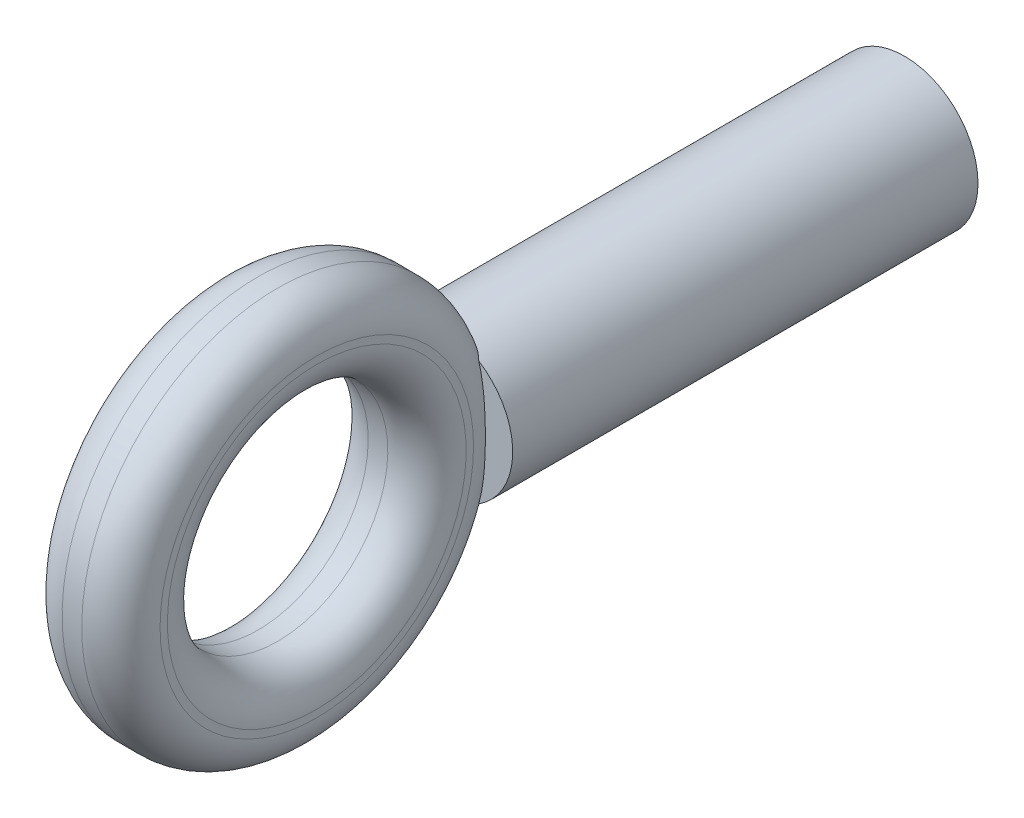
ISO-10303-21;
HEADER;
FILE_DESCRIPTION(('STEP AP214'),'2;1');
FILE_NAME('part.step','',(''),(''),'','','');
FILE_SCHEMA(('AUTOMOTIVE_DESIGN { 1 0 10303 214 1 1 1 1 }'));
ENDSEC;
DATA;
#1=APPLICATION_CONTEXT('core data for automotive mechanical design processes');
#2=APPLICATION_PROTOCOL_DEFINITION('international standard','automotive_design',2000,#1);
#3=PRODUCT_CONTEXT('',#1,'mechanical');
#4=PRODUCT('Part','Part','',(#3));
#5=PRODUCT_RELATED_PRODUCT_CATEGORY('part','',(#4));
#6=PRODUCT_DEFINITION_FORMATION('','',#4);
#7=PRODUCT_DEFINITION_CONTEXT('part definition',#1,'design');
#8=PRODUCT_DEFINITION('design','',#6,#7);
#9=PRODUCT_DEFINITION_SHAPE('','',#8);
#10=(LENGTH_UNIT() NAMED_UNIT(*) SI_UNIT(.MILLI.,.METRE.));
#11=(NAMED_UNIT(*) PLANE_ANGLE_UNIT() SI_UNIT($,.RADIAN.));
#12=(NAMED_UNIT(*) SI_UNIT($,.STERADIAN.) SOLID_ANGLE_UNIT());
#13=UNCERTAINTY_MEASURE_WITH_UNIT(LENGTH_MEASURE(1.E-05),#10,'distance_accuracy_value','');
#14=(GEOMETRIC_REPRESENTATION_CONTEXT(3) GLOBAL_UNCERTAINTY_ASSIGNED_CONTEXT((#13)) GLOBAL_UNIT_ASSIGNED_CONTEXT((#10,
#11,#12)) REPRESENTATION_CONTEXT('',''));
#15=CARTESIAN_POINT('',(0.,0.,0.));
#16=DIRECTION('',(0.,0.,1.));
#17=DIRECTION('',(1.,0.,0.));
#18=AXIS2_PLACEMENT_3D('',#15,#16,#17);
#19=CARTESIAN_POINT('',(9.49999999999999,8.26249999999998,30.5));
#20=DIRECTION('',(0.,0.,-1.));
#21=DIRECTION('',(-1.,0.,0.));
#22=AXIS2_PLACEMENT_3D('',#19,#20,#21);
#23=PLANE('',#22);
#24=CARTESIAN_POINT('',(9.49999999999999,8.26249999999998,30.5));
#25=DIRECTION('',(0.,0.,1.));
#26=DIRECTION('',(1.,0.,0.));
#27=AXIS2_PLACEMENT_3D('',#24,#25,#26);
#28=CIRCLE('',#27,1.5);
#29=CARTESIAN_POINT('',(11.,8.26249999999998,30.5));
#30=VERTEX_POINT('',#29);
#31=EDGE_CURVE('E232',#30,#30,#28,.F.);
#32=ORIENTED_EDGE('',*,*,#31,.T.);
#33=EDGE_LOOP('',(#32));
#34=FACE_BOUND('',#33,.T.);
#35=ADVANCED_FACE('F40',(#34),#23,.T.);
#36=CARTESIAN_POINT('',(8.50000000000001,8.26249999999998,43.5));
#37=DIRECTION('',(1.,0.,0.));
#38=DIRECTION('',(0.,0.,-1.));
#39=AXIS2_PLACEMENT_3D('',#36,#37,#38);
#40=CYLINDRICAL_SURFACE('',#39,2.25);
#41=CARTESIAN_POINT('',(9.7,8.26249999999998,43.5));
#42=DIRECTION('',(1.,0.,0.));
#43=DIRECTION('',(0.,0.995291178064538,0.0969302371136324));
#44=AXIS2_PLACEMENT_3D('',#41,#42,#43);
#45=CIRCLE('',#44,2.25);
#46=CARTESIAN_POINT('',(9.7,10.5019051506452,43.7180930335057));
#47=VERTEX_POINT('',#46);
#48=EDGE_CURVE('E228',#47,#47,#45,.F.);
#49=ORIENTED_EDGE('',*,*,#48,.F.);
#50=EDGE_LOOP('',(#49));
#51=FACE_BOUND('',#50,.T.);
#52=CARTESIAN_POINT('',(9.3,8.26249999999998,43.5));
#53=DIRECTION('',(1.,0.,0.));
#54=DIRECTION('',(0.,0.997665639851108,-0.0682881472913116));
#55=AXIS2_PLACEMENT_3D('',#52,#53,#54);
#56=CIRCLE('',#55,2.25);
#57=CARTESIAN_POINT('',(9.3,10.507247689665,43.3463516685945));
#58=VERTEX_POINT('',#57);
#59=EDGE_CURVE('E226',#58,#58,#56,.T.);
#60=ORIENTED_EDGE('',*,*,#59,.F.);
#61=EDGE_LOOP('',(#60));
#62=FACE_BOUND('',#61,.T.);
#63=ADVANCED_FACE('F42',(#51,#62),#40,.F.);
#64=CARTESIAN_POINT('',(9.7,8.26249999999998,43.5));
#65=DIRECTION('',(1.,0.,0.));
#66=DIRECTION('',(0.,0.995291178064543,0.0969302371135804));
#67=AXIS2_PLACEMENT_3D('',#64,#65,#66);
#68=TOROIDAL_SURFACE('',#67,3.05000000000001,0.8);
#69=ORIENTED_EDGE('',*,*,#48,.T.);
#70=EDGE_LOOP('',(#69));
#71=FACE_BOUND('',#70,.T.);
#72=CARTESIAN_POINT('',(10.4999999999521,8.26249999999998,43.5));
#73=DIRECTION('',(1.,0.,0.));
#74=DIRECTION('',(0.,-1.,0.));
#75=AXIS2_PLACEMENT_3D('',#72,#73,#74);
#76=CIRCLE('',#75,3.04999124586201);
#77=CARTESIAN_POINT('',(10.4999999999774,11.3124919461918,43.4999999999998));
#78=VERTEX_POINT('',#77);
#79=CARTESIAN_POINT('',(10.4999999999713,5.2125087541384,43.5));
#80=VERTEX_POINT('',#79);
#81=EDGE_CURVE('E120',#78,#80,#76,.F.);
#82=ORIENTED_EDGE('',*,*,#81,.F.);
#83=CARTESIAN_POINT('',(10.4999999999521,11.31249124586,43.4999999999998));
#84=CARTESIAN_POINT('',(10.5000000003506,11.3125064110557,43.5427443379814));
#85=CARTESIAN_POINT('',(10.5000000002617,11.3116404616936,43.5854859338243));
#86=CARTESIAN_POINT('',(10.4999999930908,11.3088393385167,43.6537140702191));
#87=CARTESIAN_POINT('',(10.4999999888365,11.3074744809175,43.6792246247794));
#88=CARTESIAN_POINT('',(10.4999999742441,11.3037872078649,43.7350653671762));
#89=CARTESIAN_POINT('',(10.4999999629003,11.3013318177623,43.7653868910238));
#90=CARTESIAN_POINT('',(10.4999999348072,11.2952256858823,43.8289016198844));
#91=CARTESIAN_POINT('',(10.4999999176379,11.2914815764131,43.8620858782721));
#92=CARTESIAN_POINT('',(10.4999998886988,11.28291839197,43.9280817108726));
#93=CARTESIAN_POINT('',(10.4999998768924,11.2781069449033,43.9608942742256));
#94=CARTESIAN_POINT('',(10.4999998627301,11.2683432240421,44.0205888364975));
#95=CARTESIAN_POINT('',(10.4999998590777,11.2635644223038,44.0474992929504));
#96=CARTESIAN_POINT('',(10.4999998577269,11.2533061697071,44.1010222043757));
#97=CARTESIAN_POINT('',(10.4999998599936,11.2478309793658,44.1276354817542));
#98=CARTESIAN_POINT('',(10.4999998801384,11.2283307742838,44.2162861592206));
#99=CARTESIAN_POINT('',(10.4999999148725,11.2126850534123,44.2779769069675));
#100=CARTESIAN_POINT('',(10.4999999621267,11.1808181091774,44.388896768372));
#101=CARTESIAN_POINT('',(10.4999999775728,11.1652423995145,44.4383140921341));
#102=CARTESIAN_POINT('',(10.4999999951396,11.1293036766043,44.5430999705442));
#103=CARTESIAN_POINT('',(10.4999999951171,11.1085763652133,44.5983442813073));
#104=CARTESIAN_POINT('',(10.4999999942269,11.0658111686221,44.7031107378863));
#105=CARTESIAN_POINT('',(10.4999999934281,11.0440173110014,44.752732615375));
#106=CARTESIAN_POINT('',(10.4999999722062,11.0087128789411,44.8277556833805));
#107=CARTESIAN_POINT('',(10.4999999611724,10.9961171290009,44.8535906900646));
#108=CARTESIAN_POINT('',(10.4999999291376,10.9705630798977,44.9041884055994));
#109=CARTESIAN_POINT('',(10.4999999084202,10.9576243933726,44.928961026));
#110=CARTESIAN_POINT('',(10.4999998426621,10.914822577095,45.0081956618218));
#111=CARTESIAN_POINT('',(10.4999997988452,10.8836044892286,45.0619338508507));
#112=CARTESIAN_POINT('',(10.4999997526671,10.8200458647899,45.163932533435));
#113=CARTESIAN_POINT('',(10.499999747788,10.787911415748,45.2123216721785));
#114=CARTESIAN_POINT('',(10.4999997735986,10.7391800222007,45.2812703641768));
#115=CARTESIAN_POINT('',(10.4999997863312,10.7236736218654,45.30260667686));
#116=CARTESIAN_POINT('',(10.4999998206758,10.6926564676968,45.3441142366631));
#117=CARTESIAN_POINT('',(10.4999998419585,10.6771651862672,45.3643000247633));
#118=CARTESIAN_POINT('',(10.4999998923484,10.6370361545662,45.4152498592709));
#119=CARTESIAN_POINT('',(10.4999999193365,10.6120460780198,45.445737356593));
#120=CARTESIAN_POINT('',(10.4999999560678,10.5628835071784,45.5034229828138));
#121=CARTESIAN_POINT('',(10.499999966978,10.5387960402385,45.5306937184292));
#122=CARTESIAN_POINT('',(10.49999998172,10.4925844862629,45.5811789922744));
#123=CARTESIAN_POINT('',(10.4999999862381,10.4705666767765,45.6044907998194));
#124=CARTESIAN_POINT('',(10.4999999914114,10.4277659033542,45.6484179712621));
#125=CARTESIAN_POINT('',(10.4999999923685,10.4070423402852,45.6690913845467));
#126=CARTESIAN_POINT('',(10.4999999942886,10.3500142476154,45.7243893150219));
#127=CARTESIAN_POINT('',(10.4999999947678,10.3131469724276,45.7584387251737));
#128=CARTESIAN_POINT('',(10.4999999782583,10.2644264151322,45.8013358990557));
#129=CARTESIAN_POINT('',(10.4999999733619,10.2532874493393,45.8110060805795));
#130=CARTESIAN_POINT('',(10.4999999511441,10.2129779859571,45.8454939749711));
#131=CARTESIAN_POINT('',(10.4999999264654,10.183409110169,45.8698491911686));
#132=CARTESIAN_POINT('',(10.4999998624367,10.1074911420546,45.929988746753));
#133=CARTESIAN_POINT('',(10.4999998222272,10.0605342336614,45.9650091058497));
#134=CARTESIAN_POINT('',(10.4999997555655,9.96466731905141,46.0322672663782));
#135=CARTESIAN_POINT('',(10.4999997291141,9.91575722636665,46.0645049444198));
#136=CARTESIAN_POINT('',(10.499999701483,9.81614714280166,46.1260859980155));
#137=CARTESIAN_POINT('',(10.4999997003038,9.76544712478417,46.1554293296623));
#138=CARTESIAN_POINT('',(10.4999997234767,9.66242637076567,46.2111239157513));
#139=CARTESIAN_POINT('',(10.4999997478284,9.61010565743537,46.2374752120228));
#140=CARTESIAN_POINT('',(10.4999997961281,9.53055105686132,46.2746875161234));
#141=CARTESIAN_POINT('',(10.4999998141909,9.50385288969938,46.2867062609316));
#142=CARTESIAN_POINT('',(10.4999998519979,9.45011872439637,46.3099630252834));
#143=CARTESIAN_POINT('',(10.4999998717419,9.42308273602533,46.3212010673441));
#144=CARTESIAN_POINT('',(10.4999999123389,9.36539276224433,46.3442056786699));
#145=CARTESIAN_POINT('',(10.4999999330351,9.33469820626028,46.3558706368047));
#146=CARTESIAN_POINT('',(10.4999999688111,9.27294571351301,46.3781883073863));
#147=CARTESIAN_POINT('',(10.4999999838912,9.24188779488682,46.3888410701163));
#148=CARTESIAN_POINT('',(10.5000000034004,9.16510213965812,46.4138161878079));
#149=CARTESIAN_POINT('',(10.4999999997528,9.11919044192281,46.4275758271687));
#150=CARTESIAN_POINT('',(10.4999999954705,9.02039819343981,46.4547393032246));
#151=CARTESIAN_POINT('',(10.4999999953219,8.96743175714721,46.4678309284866));
#152=CARTESIAN_POINT('',(10.5000000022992,8.8608817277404,46.4912218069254));
#153=CARTESIAN_POINT('',(10.5000000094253,8.80729811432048,46.5015209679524));
#154=CARTESIAN_POINT('',(10.4999999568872,8.72607557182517,46.5149613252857));
#155=CARTESIAN_POINT('',(10.4999999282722,8.69860382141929,46.5191354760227));
#156=CARTESIAN_POINT('',(10.4999998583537,8.64449209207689,46.5265903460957));
#157=CARTESIAN_POINT('',(10.4999998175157,8.61785565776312,46.5298966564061));
#158=CARTESIAN_POINT('',(10.499999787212,8.52575029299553,46.539903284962));
#159=CARTESIAN_POINT('',(10.4999999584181,8.46004978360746,46.5445617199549));
#160=CARTESIAN_POINT('',(10.5000000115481,8.36543648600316,46.5484119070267));
#161=CARTESIAN_POINT('',(10.5000000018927,8.33656900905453,46.5492043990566));
#162=CARTESIAN_POINT('',(10.4999999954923,8.27964269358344,46.5500209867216));
#163=CARTESIAN_POINT('',(10.4999999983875,8.25158422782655,46.550066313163));
#164=CARTESIAN_POINT('',(10.5000000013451,8.18697788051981,46.549287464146));
#165=CARTESIAN_POINT('',(10.5000000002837,8.15043294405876,46.5481957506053));
#166=CARTESIAN_POINT('',(10.4999999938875,8.08351279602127,46.5449971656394));
#167=CARTESIAN_POINT('',(10.499999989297,8.05312785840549,46.543090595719));
#168=CARTESIAN_POINT('',(10.4999999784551,7.9924291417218,46.5383610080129));
#169=CARTESIAN_POINT('',(10.4999999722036,7.96211536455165,46.5355379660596));
#170=CARTESIAN_POINT('',(10.4999999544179,7.87696239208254,46.5263130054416));
#171=CARTESIAN_POINT('',(10.4999999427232,7.82223255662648,46.518867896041));
#172=CARTESIAN_POINT('',(10.4999999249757,7.71326263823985,46.5010007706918));
#173=CARTESIAN_POINT('',(10.4999999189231,7.65902256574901,46.4905786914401));
#174=CARTESIAN_POINT('',(10.4999999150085,7.55119112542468,46.4667891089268));
#175=CARTESIAN_POINT('',(10.4999999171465,7.49759976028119,46.4534215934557));
#176=CARTESIAN_POINT('',(10.4999999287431,7.39122811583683,46.4237808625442));
#177=CARTESIAN_POINT('',(10.4999999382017,7.33844782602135,46.4075076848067));
#178=CARTESIAN_POINT('',(10.4999999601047,7.23385387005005,46.3721055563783));
#179=CARTESIAN_POINT('',(10.4999999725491,7.18204017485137,46.352976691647));
#180=CARTESIAN_POINT('',(10.4999999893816,7.09630367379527,46.3186307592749));
#181=CARTESIAN_POINT('',(10.4999999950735,7.06207200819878,46.3041805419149));
#182=CARTESIAN_POINT('',(10.4999999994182,7.0104327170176,46.2812651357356));
#183=CARTESIAN_POINT('',(10.5000000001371,6.9928237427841,46.2732501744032));
#184=CARTESIAN_POINT('',(10.4999999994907,6.92168983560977,46.2400742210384));
#185=CARTESIAN_POINT('',(10.4999999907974,6.86878761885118,46.2135544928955));
#186=CARTESIAN_POINT('',(10.5000000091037,6.76460726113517,46.1575164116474));
#187=CARTESIAN_POINT('',(10.5000000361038,6.71332914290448,46.1279980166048));
#188=CARTESIAN_POINT('',(10.4999999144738,6.60938156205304,46.064316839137));
#189=CARTESIAN_POINT('',(10.4999997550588,6.55681724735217,46.0299807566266));
#190=CARTESIAN_POINT('',(10.4999997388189,6.47748122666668,45.9741425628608));
#191=CARTESIAN_POINT('',(10.4999997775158,6.44982850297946,45.9538864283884));
#192=CARTESIAN_POINT('',(10.4999998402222,6.39968503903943,45.9158495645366));
#193=CARTESIAN_POINT('',(10.4999998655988,6.37708992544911,45.898206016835));
#194=CARTESIAN_POINT('',(10.4999999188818,6.32575737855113,45.856933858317));
#195=CARTESIAN_POINT('',(10.4999999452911,6.29719453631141,45.8330875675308));
#196=CARTESIAN_POINT('',(10.4999999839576,6.23647506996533,45.7804927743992));
#197=CARTESIAN_POINT('',(10.4999999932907,6.20447064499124,45.7515684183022));
#198=CARTESIAN_POINT('',(10.5000000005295,6.14667296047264,45.6971038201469));
#199=CARTESIAN_POINT('',(10.5000000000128,6.12069961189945,45.6717543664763));
#200=CARTESIAN_POINT('',(10.4999999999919,6.07975778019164,45.6304001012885));
#201=CARTESIAN_POINT('',(10.5000000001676,6.06450741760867,45.6146733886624));
#202=CARTESIAN_POINT('',(10.4999999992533,6.02780914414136,45.5760209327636));
#203=CARTESIAN_POINT('',(10.4999999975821,6.00653776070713,45.5529273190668));
#204=CARTESIAN_POINT('',(10.4999999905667,5.94771220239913,45.4870360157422));
#205=CARTESIAN_POINT('',(10.4999999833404,5.91098867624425,45.4434916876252));
#206=CARTESIAN_POINT('',(10.4999999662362,5.8400396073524,45.354414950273));
#207=CARTESIAN_POINT('',(10.4999999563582,5.80581414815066,45.3088824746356));
#208=CARTESIAN_POINT('',(10.4999999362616,5.73997030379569,45.2159670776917));
#209=CARTESIAN_POINT('',(10.499999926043,5.70835198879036,45.1685841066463));
#210=CARTESIAN_POINT('',(10.4999999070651,5.64782207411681,45.0721186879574));
#211=CARTESIAN_POINT('',(10.4999998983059,5.61891052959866,45.0230362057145));
#212=CARTESIAN_POINT('',(10.4999998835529,5.56388554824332,44.9233261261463));
#213=CARTESIAN_POINT('',(10.4999998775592,5.53777215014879,44.8726985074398));
#214=CARTESIAN_POINT('',(10.4999998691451,5.48842590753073,44.7700579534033));
#215=CARTESIAN_POINT('',(10.4999998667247,5.4651930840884,44.7180450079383));
#216=CARTESIAN_POINT('',(10.499999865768,5.42168133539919,44.6127978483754));
#217=CARTESIAN_POINT('',(10.4999998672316,5.40140241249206,44.5595636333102));
#218=CARTESIAN_POINT('',(10.499999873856,5.36386245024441,44.4520418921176));
#219=CARTESIAN_POINT('',(10.4999998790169,5.34660139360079,44.3977543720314));
#220=CARTESIAN_POINT('',(10.4999998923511,5.3151515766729,44.2882973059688));
#221=CARTESIAN_POINT('',(10.4999999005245,5.30096277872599,44.2331277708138));
#222=CARTESIAN_POINT('',(10.499999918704,5.27570220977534,44.1220807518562));
#223=CARTESIAN_POINT('',(10.4999999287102,5.26463038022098,44.0662032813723));
#224=CARTESIAN_POINT('',(10.4999999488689,5.24563841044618,43.9539167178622));
#225=CARTESIAN_POINT('',(10.4999999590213,5.2377181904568,43.8975076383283));
#226=CARTESIAN_POINT('',(10.499999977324,5.2250548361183,43.7843358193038));
#227=CARTESIAN_POINT('',(10.4999999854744,5.22031160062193,43.7275730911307));
#228=CARTESIAN_POINT('',(10.4999999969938,5.2140148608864,43.6138732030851));
#229=CARTESIAN_POINT('',(10.5000000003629,5.21246123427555,43.5569360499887));
#230=CARTESIAN_POINT('',(10.4999999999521,5.21250875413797,43.5000000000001));
#231=B_SPLINE_CURVE_WITH_KNOTS('',3,(#83,#84,#85,#86,#87,#88,#89,#90,#91,#92,#93,#94,#95,#96,
#97,#98,#99,#100,#101,#102,#103,#104,#105,#106,#107,#108,#109,#110,#111,#112,#113,#114,#115,
#116,#117,#118,#119,#120,#121,#122,#123,#124,#125,#126,#127,#128,#129,#130,#131,#132,#133,#134,
#135,#136,#137,#138,#139,#140,#141,#142,#143,#144,#145,#146,#147,#148,#149,#150,#151,#152,#153,
#154,#155,#156,#157,#158,#159,#160,#161,#162,#163,#164,#165,#166,#167,#168,#169,#170,#171,#172,
#173,#174,#175,#176,#177,#178,#179,#180,#181,#182,#183,#184,#185,#186,#187,#188,#189,#190,#191,
#192,#193,#194,#195,#196,#197,#198,#199,#200,#201,#202,#203,#204,#205,#206,#207,#208,#209,#210,
#211,#212,#213,#214,#215,#216,#217,#218,#219,#220,#221,#222,#223,#224,#225,#226,#227,#228,#229,
#230),.UNSPECIFIED.,.F.,.F.,(4,2,2,2,2,2,2,2,2,2,2,2,2,2,2,2,2,2,2,2,2,2,2,2,2,2,2,2,2,2,2,2,2,
2,2,2,2,2,2,2,2,2,2,2,2,2,2,2,2,2,2,2,2,2,2,2,2,2,2,2,2,2,2,2,2,2,2,2,2,2,2,2,2,4),(0.,
0.128216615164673,0.204850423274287,0.296098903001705,0.396264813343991,0.495736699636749,
0.577720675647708,0.659225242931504,0.850009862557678,1.00539242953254,1.18230660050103,
1.34481963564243,1.43103546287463,1.51487080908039,1.7011847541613,1.8753440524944,
1.95446380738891,2.03079089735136,2.14902153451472,2.25815563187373,2.3543370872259,
2.44214410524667,2.59262825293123,2.63688050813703,2.75177601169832,2.9274063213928,
3.10304441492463,3.27868517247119,3.45432347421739,3.5421493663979,3.62997272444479,
3.72846376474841,3.82694990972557,3.97068506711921,4.13429274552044,4.29790582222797,
4.38125837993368,4.46177153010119,4.65918037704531,4.7458113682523,4.82997634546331,
4.9396355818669,5.03095603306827,5.1222788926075,5.28789167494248,5.45350797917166,
5.61912496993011,5.78473981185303,5.95034966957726,6.06179398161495,6.11983401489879,
6.29725268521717,6.47467383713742,6.66288896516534,6.76570181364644,6.85169439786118,
6.96329474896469,7.0926702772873,7.2015280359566,7.26724389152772,7.36142212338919,
7.53221267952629,7.70300894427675,7.87380980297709,8.04461414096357,8.21542084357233,
8.38622879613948,8.55703688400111,8.72784399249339,8.89864900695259,9.06945081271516,
9.24024829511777,9.41104033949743,9.58182583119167),.UNSPECIFIED.);
#232=EDGE_CURVE('E118',#80,#78,#231,.F.);
#233=ORIENTED_EDGE('',*,*,#232,.F.);
#234=EDGE_LOOP('',(#82,#233));
#235=FACE_BOUND('',#234,.T.);
#236=ADVANCED_FACE('F278',(#71,#235),#68,.T.);
#237=CARTESIAN_POINT('',(9.3,8.26249999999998,43.5));
#238=DIRECTION('',(1.,0.,0.));
#239=DIRECTION('',(0.,0.997665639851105,-0.0682881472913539));
#240=AXIS2_PLACEMENT_3D('',#237,#238,#239);
#241=TOROIDAL_SURFACE('',#240,3.05000000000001,0.8);
#242=CARTESIAN_POINT('',(8.50000000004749,11.3053715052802,43.2917217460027));
#243=CARTESIAN_POINT('',(8.50000000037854,11.3028076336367,43.2542576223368));
#244=CARTESIAN_POINT('',(8.50000000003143,11.2995566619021,43.2168405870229));
#245=CARTESIAN_POINT('',(8.50000000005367,11.291686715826,43.1421503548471));
#246=CARTESIAN_POINT('',(8.50000000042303,11.2870677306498,43.1048771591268));
#247=CARTESIAN_POINT('',(8.50000000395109,11.2764678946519,43.0305241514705));
#248=CARTESIAN_POINT('',(8.50000000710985,11.2704870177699,42.9934443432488));
#249=CARTESIAN_POINT('',(8.50000001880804,11.2571694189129,42.9195279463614));
#250=CARTESIAN_POINT('',(8.50000002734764,11.2498326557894,42.8826913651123));
#251=CARTESIAN_POINT('',(8.50000005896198,11.2338205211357,42.8093085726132));
#252=CARTESIAN_POINT('',(8.50000008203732,11.2251450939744,42.7727623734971));
#253=CARTESIAN_POINT('',(8.50000013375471,11.2064341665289,42.6999982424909));
#254=CARTESIAN_POINT('',(8.50000016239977,11.1963979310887,42.663780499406));
#255=CARTESIAN_POINT('',(8.50000019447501,11.1749573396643,42.5917514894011));
#256=CARTESIAN_POINT('',(8.50000019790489,11.1635529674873,42.5559402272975));
#257=CARTESIAN_POINT('',(8.50000018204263,11.1393936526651,42.484777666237));
#258=CARTESIAN_POINT('',(8.50000016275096,11.126638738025,42.4494263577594));
#259=CARTESIAN_POINT('',(8.50000010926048,11.0998196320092,42.379224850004));
#260=CARTESIAN_POINT('',(8.50000007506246,11.0857555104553,42.3443746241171));
#261=CARTESIAN_POINT('',(8.50000002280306,11.0562477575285,42.2752678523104));
#262=CARTESIAN_POINT('',(8.50000000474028,11.0408042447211,42.2410112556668));
#263=CARTESIAN_POINT('',(8.49999999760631,11.0165539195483,42.1893024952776));
#264=CARTESIAN_POINT('',(8.49999999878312,11.0081180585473,42.1716737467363));
#265=CARTESIAN_POINT('',(8.50000000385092,10.9784732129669,42.1112132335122));
#266=CARTESIAN_POINT('',(8.50000000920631,10.9564274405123,42.0687858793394));
#267=CARTESIAN_POINT('',(8.5000000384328,10.9167861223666,41.9966694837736));
#268=CARTESIAN_POINT('',(8.50000005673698,10.8996592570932,41.9667210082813));
#269=CARTESIAN_POINT('',(8.50000009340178,10.870485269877,41.9176633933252));
#270=CARTESIAN_POINT('',(8.5000001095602,10.8587263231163,41.8983824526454));
#271=CARTESIAN_POINT('',(8.50000015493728,10.8247211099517,41.8440097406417));
#272=CARTESIAN_POINT('',(8.50000018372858,10.8019603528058,41.8092374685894));
#273=CARTESIAN_POINT('',(8.50000021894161,10.7577384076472,41.7446514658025));
#274=CARTESIAN_POINT('',(8.50000022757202,10.7364330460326,41.7147306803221));
#275=CARTESIAN_POINT('',(8.5000002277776,10.6904462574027,41.6525950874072));
#276=CARTESIAN_POINT('',(8.50000021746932,10.6656450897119,41.6204687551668));
#277=CARTESIAN_POINT('',(8.50000018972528,10.6147736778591,41.5572387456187));
#278=CARTESIAN_POINT('',(8.50000017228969,10.5887034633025,41.5261350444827));
#279=CARTESIAN_POINT('',(8.50000013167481,10.5353287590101,41.465007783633));
#280=CARTESIAN_POINT('',(8.50000010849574,10.5080243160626,41.4349841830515));
#281=CARTESIAN_POINT('',(8.50000006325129,10.452243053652,41.3760483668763));
#282=CARTESIAN_POINT('',(8.50000004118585,10.423766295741,41.3471360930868));
#283=CARTESIAN_POINT('',(8.50000001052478,10.3656265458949,41.2905346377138));
#284=CARTESIAN_POINT('',(8.50000000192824,10.3359636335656,41.2628453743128));
#285=CARTESIAN_POINT('',(8.49999999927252,10.2934321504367,41.2244708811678));
#286=CARTESIAN_POINT('',(8.49999999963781,10.2809433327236,41.2133598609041));
#287=CARTESIAN_POINT('',(8.5000000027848,10.2363511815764,41.174338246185));
#288=CARTESIAN_POINT('',(8.50000000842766,10.2037509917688,41.1469913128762));
#289=CARTESIAN_POINT('',(8.50000003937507,10.1261546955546,41.0846048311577));
#290=CARTESIAN_POINT('',(8.50000007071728,10.0807156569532,41.0501145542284));
#291=CARTESIAN_POINT('',(8.50000013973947,9.99504142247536,40.9888157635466));
#292=CARTESIAN_POINT('',(8.50000017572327,9.95506979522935,40.9616380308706));
#293=CARTESIAN_POINT('',(8.50000021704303,9.88099723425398,40.9138536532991));
#294=CARTESIAN_POINT('',(8.50000022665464,9.84709952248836,40.8929317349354));
#295=CARTESIAN_POINT('',(8.50000022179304,9.78950522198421,40.8589547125));
#296=CARTESIAN_POINT('',(8.50000021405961,9.76602624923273,40.8455298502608));
#297=CARTESIAN_POINT('',(8.50000019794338,9.73239419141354,40.8268979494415));
#298=CARTESIAN_POINT('',(8.50000019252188,9.72238607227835,40.8214278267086));
#299=CARTESIAN_POINT('',(8.50000016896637,9.67721471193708,40.7970660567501));
#300=CARTESIAN_POINT('',(8.5000001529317,9.64170784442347,40.778805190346));
#301=CARTESIAN_POINT('',(8.50000012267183,9.57000679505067,40.7436933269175));
#302=CARTESIAN_POINT('',(8.50000010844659,9.53381263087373,40.726842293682));
#303=CARTESIAN_POINT('',(8.50000008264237,9.46079128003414,40.6945739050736));
#304=CARTESIAN_POINT('',(8.50000007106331,9.42396410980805,40.6791565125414));
#305=CARTESIAN_POINT('',(8.5000000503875,9.3497343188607,40.6497799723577));
#306=CARTESIAN_POINT('',(8.50000004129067,9.31233171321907,40.6358207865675));
#307=CARTESIAN_POINT('',(8.50000002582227,9.23700722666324,40.6093807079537));
#308=CARTESIAN_POINT('',(8.50000001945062,9.19908535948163,40.5968997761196));
#309=CARTESIAN_POINT('',(8.50000001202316,9.14458464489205,40.5801424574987));
#310=CARTESIAN_POINT('',(8.50000001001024,9.12819212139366,40.5752530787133));
#311=CARTESIAN_POINT('',(8.50000000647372,9.09121504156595,40.5645587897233));
#312=CARTESIAN_POINT('',(8.50000000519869,9.07060812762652,40.5588310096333));
#313=CARTESIAN_POINT('',(8.50000000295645,9.01378303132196,40.5436668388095));
#314=CARTESIAN_POINT('',(8.50000000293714,8.97744649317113,40.5346704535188));
#315=CARTESIAN_POINT('',(8.50000000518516,8.90447210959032,40.5179991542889));
#316=CARTESIAN_POINT('',(8.50000000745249,8.86783426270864,40.5103242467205));
#317=CARTESIAN_POINT('',(8.50000001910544,8.79430313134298,40.4963064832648));
#318=CARTESIAN_POINT('',(8.50000002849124,8.75740983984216,40.48996366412));
#319=CARTESIAN_POINT('',(8.50000006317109,8.69398791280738,40.4802341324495));
#320=CARTESIAN_POINT('',(8.50000008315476,8.66750912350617,40.4765205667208));
#321=CARTESIAN_POINT('',(8.50000011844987,8.63032298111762,40.471802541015));
#322=CARTESIAN_POINT('',(8.50000012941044,8.61965208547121,40.4705058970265));
#323=CARTESIAN_POINT('',(8.50000017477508,8.5716027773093,40.4649346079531));
#324=CARTESIAN_POINT('',(8.5000001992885,8.53414508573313,40.4613185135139));
#325=CARTESIAN_POINT('',(8.50000021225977,8.45912100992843,40.4555302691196));
#326=CARTESIAN_POINT('',(8.50000020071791,8.42155462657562,40.4533581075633));
#327=CARTESIAN_POINT('',(8.50000014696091,8.34636680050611,40.4504251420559));
#328=CARTESIAN_POINT('',(8.50000010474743,8.30874536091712,40.4496642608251));
#329=CARTESIAN_POINT('',(8.50000003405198,8.23350869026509,40.4496936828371));
#330=CARTESIAN_POINT('',(8.50000000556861,8.19589345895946,40.4504838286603));
#331=CARTESIAN_POINT('',(8.49999999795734,8.14406819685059,40.4522833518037));
#332=CARTESIAN_POINT('',(8.49999999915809,8.12983947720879,40.452851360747));
#333=CARTESIAN_POINT('',(8.50000000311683,8.07618859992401,40.4553760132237));
#334=CARTESIAN_POINT('',(8.50000000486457,8.03679593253,40.4580099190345));
#335=CARTESIAN_POINT('',(8.50000002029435,7.94374858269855,40.4660339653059));
#336=CARTESIAN_POINT('',(8.50000003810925,7.89014956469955,40.4720799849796));
#337=CARTESIAN_POINT('',(8.50000007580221,7.79249981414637,40.485743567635));
#338=CARTESIAN_POINT('',(8.50000009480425,7.74838607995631,40.492914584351));
#339=CARTESIAN_POINT('',(8.50000011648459,7.66813180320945,40.5078054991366));
#340=CARTESIAN_POINT('',(8.5000001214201,7.63193361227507,40.5152152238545));
#341=CARTESIAN_POINT('',(8.50000011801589,7.57133797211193,40.5287917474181));
#342=CARTESIAN_POINT('',(8.50000011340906,7.54686001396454,40.5346009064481));
#343=CARTESIAN_POINT('',(8.50000010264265,7.50308491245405,40.5455693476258));
#344=CARTESIAN_POINT('',(8.50000009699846,7.48375931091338,40.5506159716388));
#345=CARTESIAN_POINT('',(8.50000007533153,7.4042234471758,40.5722212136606));
#346=CARTESIAN_POINT('',(8.50000006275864,7.34445274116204,40.590441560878));
#347=CARTESIAN_POINT('',(8.50000004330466,7.23713494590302,40.6267917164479));
#348=CARTESIAN_POINT('',(8.50000003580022,7.18937867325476,40.6443102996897));
#349=CARTESIAN_POINT('',(8.50000002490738,7.10558323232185,40.6774467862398));
#350=CARTESIAN_POINT('',(8.50000002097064,7.06935511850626,40.6925873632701));
#351=CARTESIAN_POINT('',(8.50000001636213,7.00811829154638,40.7195718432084));
#352=CARTESIAN_POINT('',(8.50000001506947,6.98295617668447,40.7310686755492));
#353=CARTESIAN_POINT('',(8.50000001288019,6.94343460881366,40.7497816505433));
#354=CARTESIAN_POINT('',(8.50000001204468,6.92896802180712,40.7567721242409));
#355=CARTESIAN_POINT('',(8.50000001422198,6.91155774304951,40.7653361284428));
#356=CARTESIAN_POINT('',(8.50000001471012,6.90856628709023,40.7668130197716));
#357=CARTESIAN_POINT('',(8.50000001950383,6.88483991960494,40.7785718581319));
#358=CARTESIAN_POINT('',(8.50000002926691,6.86421102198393,40.7890689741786));
#359=CARTESIAN_POINT('',(8.50000005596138,6.80782504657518,40.8185946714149));
#360=CARTESIAN_POINT('',(8.50000007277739,6.77232532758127,40.838117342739));
#361=CARTESIAN_POINT('',(8.50000010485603,6.70213580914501,40.8785682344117));
#362=CARTESIAN_POINT('',(8.50000012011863,6.66744603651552,40.8994965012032));
#363=CARTESIAN_POINT('',(8.50000014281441,6.59893582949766,40.9427327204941));
#364=CARTESIAN_POINT('',(8.50000015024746,6.56511541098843,40.9650406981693));
#365=CARTESIAN_POINT('',(8.50000015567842,6.4983986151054,41.0109980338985));
#366=CARTESIAN_POINT('',(8.50000015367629,6.46550224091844,41.034647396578));
#367=CARTESIAN_POINT('',(8.50000014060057,6.40068647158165,41.0832485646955));
#368=CARTESIAN_POINT('',(8.50000012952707,6.36876706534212,41.1082003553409));
#369=CARTESIAN_POINT('',(8.50000010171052,6.30596075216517,41.1593690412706));
#370=CARTESIAN_POINT('',(8.50000008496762,6.27507381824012,41.1855859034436));
#371=CARTESIAN_POINT('',(8.50000005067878,6.21436966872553,41.2392286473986));
#372=CARTESIAN_POINT('',(8.50000003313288,6.18455240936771,41.2666544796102));
#373=CARTESIAN_POINT('',(8.50000000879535,6.12608518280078,41.3227198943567));
#374=CARTESIAN_POINT('',(8.50000000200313,6.0974351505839,41.3513594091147));
#375=CARTESIAN_POINT('',(8.49999999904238,6.05483922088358,41.3954631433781));
#376=CARTESIAN_POINT('',(8.49999999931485,6.04051472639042,41.4105653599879));
#377=CARTESIAN_POINT('',(8.50000000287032,5.99409289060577,41.460507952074));
#378=CARTESIAN_POINT('',(8.50000000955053,5.96263561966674,41.4959497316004));
#379=CARTESIAN_POINT('',(8.50000003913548,5.91027433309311,41.5577781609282));
#380=CARTESIAN_POINT('',(8.50000005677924,5.88895315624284,41.5838135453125));
#381=CARTESIAN_POINT('',(8.50000009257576,5.85405070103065,41.627905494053));
#382=CARTESIAN_POINT('',(8.50000010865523,5.8402287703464,41.645771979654));
#383=CARTESIAN_POINT('',(8.5000001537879,5.8015562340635,41.6969399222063));
#384=CARTESIAN_POINT('',(8.500000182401,5.77718765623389,41.7306081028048));
#385=CARTESIAN_POINT('',(8.50000021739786,5.73262526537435,41.7949534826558));
#386=CARTESIAN_POINT('',(8.50000022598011,5.71227555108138,41.8255230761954));
#387=CARTESIAN_POINT('',(8.50000022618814,5.6706324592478,41.8906405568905));
#388=CARTESIAN_POINT('',(8.50000021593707,5.64946467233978,41.925268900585));
#389=CARTESIAN_POINT('',(8.50000018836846,5.60853726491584,41.9953465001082));
#390=CARTESIAN_POINT('',(8.50000017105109,5.58877761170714,42.0307957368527));
#391=CARTESIAN_POINT('',(8.50000013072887,5.55070687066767,42.1024617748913));
#392=CARTESIAN_POINT('',(8.50000010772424,5.53239572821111,42.1386785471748));
#393=CARTESIAN_POINT('',(8.5000000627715,5.49723245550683,42.2118119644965));
#394=CARTESIAN_POINT('',(8.50000004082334,5.48038024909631,42.2487285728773));
#395=CARTESIAN_POINT('',(8.50000001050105,5.44823169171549,42.3232300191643));
#396=CARTESIAN_POINT('',(8.50000000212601,5.43293523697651,42.360814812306));
#397=CARTESIAN_POINT('',(8.49999999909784,5.41161240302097,42.4159379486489));
#398=CARTESIAN_POINT('',(8.49999999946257,5.40506333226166,42.4332773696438));
#399=CARTESIAN_POINT('',(8.50000000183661,5.38346110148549,42.4920714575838));
#400=CARTESIAN_POINT('',(8.50000000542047,5.36913836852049,42.5337988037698));
#401=CARTESIAN_POINT('',(8.50000002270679,5.3461016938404,42.6059578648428));
#402=CARTESIAN_POINT('',(8.50000003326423,5.33694641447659,42.636249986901));
#403=CARTESIAN_POINT('',(8.50000005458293,5.3225162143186,42.6868312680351));
#404=CARTESIAN_POINT('',(8.50000006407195,5.31697479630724,42.7070446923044));
#405=CARTESIAN_POINT('',(8.50000009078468,5.30184624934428,42.7645735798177));
#406=CARTESIAN_POINT('',(8.50000010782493,5.29276122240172,42.8020226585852));
#407=CARTESIAN_POINT('',(8.50000012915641,5.2770204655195,42.8728282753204));
#408=CARTESIAN_POINT('',(8.50000013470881,5.27020477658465,42.906149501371));
#409=CARTESIAN_POINT('',(8.50000013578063,5.25705237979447,42.9765123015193));
#410=CARTESIAN_POINT('',(8.50000013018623,5.25084096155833,43.0135773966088));
#411=CARTESIAN_POINT('',(8.50000011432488,5.2398014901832,43.0879119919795));
#412=CARTESIAN_POINT('',(8.50000010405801,5.23497341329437,43.1251814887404));
#413=CARTESIAN_POINT('',(8.50000007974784,5.22671012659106,43.1998736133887));
#414=CARTESIAN_POINT('',(8.50000006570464,5.22327487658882,43.2372962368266));
#415=CARTESIAN_POINT('',(8.500000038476,5.21780133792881,43.3122419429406));
#416=CARTESIAN_POINT('',(8.50000002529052,5.21576299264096,43.3497650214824));
#417=CARTESIAN_POINT('',(8.50000000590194,5.21308574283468,43.4248591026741));
#418=CARTESIAN_POINT('',(8.49999999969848,5.21244676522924,43.4624301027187));
#419=CARTESIAN_POINT('',(8.50000000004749,5.21250871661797,43.5000000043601));
#420=B_SPLINE_CURVE_WITH_KNOTS('',3,(#242,#243,#244,#245,#246,#247,#248,#249,#250,#251,#252,
#253,#254,#255,#256,#257,#258,#259,#260,#261,#262,#263,#264,#265,#266,#267,#268,#269,#270,#271,
#272,#273,#274,#275,#276,#277,#278,#279,#280,#281,#282,#283,#284,#285,#286,#287,#288,#289,#290,
#291,#292,#293,#294,#295,#296,#297,#298,#299,#300,#301,#302,#303,#304,#305,#306,#307,#308,#309,
#310,#311,#312,#313,#314,#315,#316,#317,#318,#319,#320,#321,#322,#323,#324,#325,#326,#327,#328,
#329,#330,#331,#332,#333,#334,#335,#336,#337,#338,#339,#340,#341,#342,#343,#344,#345,#346,#347,
#348,#349,#350,#351,#352,#353,#354,#355,#356,#357,#358,#359,#360,#361,#362,#363,#364,#365,#366,
#367,#368,#369,#370,#371,#372,#373,#374,#375,#376,#377,#378,#379,#380,#381,#382,#383,#384,#385,
#386,#387,#388,#389,#390,#391,#392,#393,#394,#395,#396,#397,#398,#399,#400,#401,#402,#403,#404,
#405,#406,#407,#408,#409,#410,#411,#412,#413,#414,#415,#416,#417,#418,#419),.UNSPECIFIED.,.F.,
.F.,(4,2,2,2,2,2,2,2,2,2,2,2,2,2,2,2,2,2,2,2,2,2,2,2,2,2,2,2,2,2,2,2,2,2,2,2,2,2,2,2,2,2,2,2,2,
2,2,2,2,2,2,2,2,2,2,2,2,2,2,2,2,2,2,2,2,2,2,2,2,2,2,2,2,2,2,2,2,2,2,2,2,2,2,2,2,2,2,2,4),(0.,
0.112648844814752,0.225298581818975,0.337950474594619,0.450605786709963,0.563265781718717,
0.675986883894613,0.788709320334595,0.901429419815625,1.01414351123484,1.12684792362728,
1.18547649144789,1.32885407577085,1.43233492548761,1.50008171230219,1.6247193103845,
1.73488931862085,1.85661254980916,1.97833294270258,2.10004872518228,2.22175812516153,
2.34345937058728,2.39360666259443,2.5212221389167,2.69226728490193,2.83721988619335,
2.95669086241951,3.03781865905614,3.07203475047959,3.19178204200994,3.31152625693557,
3.43126736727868,3.55100534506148,3.67074016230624,3.72205680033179,3.78621690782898,
3.89849167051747,4.01076697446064,4.12304537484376,4.2032496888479,4.23549759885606,
4.34836094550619,4.46122338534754,4.5740796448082,4.68692445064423,4.72964442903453,
4.84805457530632,5.00979208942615,5.14382714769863,5.25464781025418,5.33011311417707,
5.39003190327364,5.57735403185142,5.72989833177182,5.84766264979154,5.93064514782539,
5.97884430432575,5.98885281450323,6.05828531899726,6.17979105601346,6.30130080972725,
6.42281278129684,6.54432517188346,6.66583618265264,6.78734401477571,6.90884686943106,
7.03034294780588,7.09278648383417,7.23489275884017,7.33583027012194,7.40359229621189,
7.52823749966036,7.63838462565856,7.76010776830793,7.88182808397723,8.00354380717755,
8.12525317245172,8.24695441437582,8.3025583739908,8.43486104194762,8.52978275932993,
8.59265683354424,8.70823113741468,8.81024625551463,8.92296514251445,9.03568209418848,
9.14839579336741,9.2611049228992,9.3738081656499),.UNSPECIFIED.);
#421=CARTESIAN_POINT('',(8.50000000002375,11.3053715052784,43.291721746));
#422=VERTEX_POINT('',#421);
#423=CARTESIAN_POINT('',(8.50000000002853,5.21250871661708,43.50000000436));
#424=VERTEX_POINT('',#423);
#425=EDGE_CURVE('E150',#422,#424,#420,.T.);
#426=ORIENTED_EDGE('',*,*,#425,.T.);
#427=CARTESIAN_POINT('',(8.50000000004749,8.26249999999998,43.5));
#428=DIRECTION('',(-1.,0.,0.));
#429=DIRECTION('',(0.,-1.,1.42955273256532E-09));
#430=AXIS2_PLACEMENT_3D('',#427,#428,#429);
#431=CIRCLE('',#430,3.04999128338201);
#432=CARTESIAN_POINT('',(8.50000000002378,5.21962849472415,43.708278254));
#433=VERTEX_POINT('',#432);
#434=EDGE_CURVE('E140',#424,#433,#431,.T.);
#435=ORIENTED_EDGE('',*,*,#434,.T.);
#436=CARTESIAN_POINT('',(8.50000000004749,8.26249999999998,43.5));
#437=DIRECTION('',(-1.,0.,0.));
#438=DIRECTION('',(0.,-0.997665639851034,0.068288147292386));
#439=AXIS2_PLACEMENT_3D('',#436,#437,#438);
#440=CIRCLE('',#439,3.04999128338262);
#441=CARTESIAN_POINT('',(8.50000000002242,11.3124919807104,43.4999999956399));
#442=VERTEX_POINT('',#441);
#443=EDGE_CURVE('E146',#433,#442,#440,.T.);
#444=ORIENTED_EDGE('',*,*,#443,.T.);
#445=CARTESIAN_POINT('',(8.50000000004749,11.31249128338,43.4999999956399));
#446=CARTESIAN_POINT('',(8.50000000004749,11.3124912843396,43.4913149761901));
#447=CARTESIAN_POINT('',(8.50000000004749,11.3124541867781,43.4826299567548));
#448=CARTESIAN_POINT('',(8.50000000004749,11.312305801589,43.4652605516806));
#449=CARTESIAN_POINT('',(8.50000000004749,11.3121945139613,43.4565761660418));
#450=CARTESIAN_POINT('',(8.50000000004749,11.311897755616,43.4392086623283));
#451=CARTESIAN_POINT('',(8.50000000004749,11.3117122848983,43.4305255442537));
#452=CARTESIAN_POINT('',(8.50000000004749,11.3112671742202,43.4131612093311));
#453=CARTESIAN_POINT('',(8.50000000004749,11.3110075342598,43.4044799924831));
#454=CARTESIAN_POINT('',(8.50000000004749,11.31041410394,43.3871200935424));
#455=CARTESIAN_POINT('',(8.50000000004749,11.3100803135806,43.3784414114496));
#456=CARTESIAN_POINT('',(8.50000000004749,11.3093386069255,43.3610872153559));
#457=CARTESIAN_POINT('',(8.50000000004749,11.3089306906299,43.352411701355));
#458=CARTESIAN_POINT('',(8.50000000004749,11.308040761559,43.3350644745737));
#459=CARTESIAN_POINT('',(8.50000000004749,11.3075587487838,43.3263927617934));
#460=CARTESIAN_POINT('',(8.50000000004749,11.3065206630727,43.3090537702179));
#461=CARTESIAN_POINT('',(8.50000000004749,11.3059645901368,43.3003864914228));
#462=CARTESIAN_POINT('',(8.50000000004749,11.3053715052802,43.2917217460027));
#463=B_SPLINE_CURVE_WITH_KNOTS('',3,(#445,#446,#447,#448,#449,#450,#451,#452,#453,#454,#455,
#456,#457,#458,#459,#460,#461,#462),.UNSPECIFIED.,.F.,.F.,(4,2,2,2,2,2,2,2,4),(0.,
0.0260549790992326,0.052109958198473,0.0781649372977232,0.104219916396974,0.130274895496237,
0.156329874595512,0.182384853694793,0.208439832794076),.UNSPECIFIED.);
#464=EDGE_CURVE('E158',#442,#422,#463,.T.);
#465=ORIENTED_EDGE('',*,*,#464,.T.);
#466=EDGE_LOOP('',(#426,#435,#444,#465));
#467=FACE_BOUND('',#466,.T.);
#468=ORIENTED_EDGE('',*,*,#59,.T.);
#469=EDGE_LOOP('',(#468));
#470=FACE_BOUND('',#469,.T.);
#471=ADVANCED_FACE('F143',(#467,#470),#241,.T.);
#472=CARTESIAN_POINT('',(10.5,8.2625,43.5));
#473=DIRECTION('',(1.,0.,0.));
#474=DIRECTION('',(0.,0.,-1.));
#475=AXIS2_PLACEMENT_3D('',#472,#473,#474);
#476=PLANE('',#475);
#477=ORIENTED_EDGE('',*,*,#232,.T.);
#478=ORIENTED_EDGE('',*,*,#81,.T.);
#479=EDGE_LOOP('',(#477,#478));
#480=FACE_BOUND('',#479,.T.);
#481=CARTESIAN_POINT('',(10.4999999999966,8.26249999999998,43.5));
#482=DIRECTION('',(-1.,0.,0.));
#483=DIRECTION('',(0.,1.,0.));
#484=AXIS2_PLACEMENT_3D('',#481,#482,#483);
#485=CIRCLE('',#484,3.19999766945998);
#486=CARTESIAN_POINT('',(10.4999999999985,11.4624979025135,43.4999999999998));
#487=VERTEX_POINT('',#486);
#488=CARTESIAN_POINT('',(10.499999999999,5.062501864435,43.5));
#489=VERTEX_POINT('',#488);
#490=EDGE_CURVE('E328',#487,#489,#485,.T.);
#491=ORIENTED_EDGE('',*,*,#490,.F.);
#492=CARTESIAN_POINT('',(10.4999999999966,5.062502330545,43.5));
#493=CARTESIAN_POINT('',(10.5000000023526,5.06248949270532,43.5410007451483));
#494=CARTESIAN_POINT('',(10.5000000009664,5.06325244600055,43.5820073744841));
#495=CARTESIAN_POINT('',(10.4999999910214,5.06732464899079,43.6900341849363));
#496=CARTESIAN_POINT('',(10.4999999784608,5.07194493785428,43.7570085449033));
#497=CARTESIAN_POINT('',(10.4999999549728,5.08411155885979,43.8775206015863));
#498=CARTESIAN_POINT('',(10.4999999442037,5.09091289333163,43.9311351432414));
#499=CARTESIAN_POINT('',(10.4999999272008,5.10723304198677,44.0379515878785));
#500=CARTESIAN_POINT('',(10.499999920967,5.11675190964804,44.091153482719));
#501=CARTESIAN_POINT('',(10.4999999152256,5.13848580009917,44.1970035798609));
#502=CARTESIAN_POINT('',(10.4999999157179,5.15070083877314,44.2496517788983));
#503=CARTESIAN_POINT('',(10.4999999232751,5.1777951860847,44.3542580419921));
#504=CARTESIAN_POINT('',(10.4999999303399,5.19267447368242,44.4062161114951));
#505=CARTESIAN_POINT('',(10.4999999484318,5.22505545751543,44.5093060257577));
#506=CARTESIAN_POINT('',(10.4999999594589,5.24255709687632,44.5604378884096));
#507=CARTESIAN_POINT('',(10.4999999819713,5.28321774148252,44.6700131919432));
#508=CARTESIAN_POINT('',(10.4999999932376,5.30683388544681,44.7282879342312));
#509=CARTESIAN_POINT('',(10.5000000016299,5.35164761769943,44.8301842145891));
#510=CARTESIAN_POINT('',(10.5000000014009,5.37216274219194,44.8741084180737));
#511=CARTESIAN_POINT('',(10.4999999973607,5.41930849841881,44.9694881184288));
#512=CARTESIAN_POINT('',(10.4999999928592,5.44635136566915,45.0207409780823));
#513=CARTESIAN_POINT('',(10.500000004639,5.50315610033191,45.1217148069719));
#514=CARTESIAN_POINT('',(10.500000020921,5.53291806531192,45.1714357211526));
#515=CARTESIAN_POINT('',(10.4999998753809,5.59078890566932,45.2627408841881));
#516=CARTESIAN_POINT('',(10.4999997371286,5.61858502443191,45.3045227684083));
#517=CARTESIAN_POINT('',(10.4999996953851,5.67255912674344,45.3811285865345));
#518=CARTESIAN_POINT('',(10.4999997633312,5.69846687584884,45.4161433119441));
#519=CARTESIAN_POINT('',(10.499999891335,5.7639494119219,45.5010124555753));
#520=CARTESIAN_POINT('',(10.4999999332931,5.80431546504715,45.5502609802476));
#521=CARTESIAN_POINT('',(10.4999999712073,5.85896889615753,45.6130080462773));
#522=CARTESIAN_POINT('',(10.4999999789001,5.87196187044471,45.6276502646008));
#523=CARTESIAN_POINT('',(10.5000000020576,5.92566330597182,45.6870778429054));
#524=CARTESIAN_POINT('',(10.5000000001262,5.96750255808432,45.7308570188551));
#525=CARTESIAN_POINT('',(10.4999999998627,6.0306546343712,45.7934086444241));
#526=CARTESIAN_POINT('',(10.5000000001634,6.05106151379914,45.8131080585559));
#527=CARTESIAN_POINT('',(10.4999999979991,6.08988200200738,45.8496215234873));
#528=CARTESIAN_POINT('',(10.4999999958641,6.10823828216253,45.8664964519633));
#529=CARTESIAN_POINT('',(10.4999999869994,6.16979150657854,45.9217564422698));
#530=CARTESIAN_POINT('',(10.4999999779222,6.21385165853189,45.9591881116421));
#531=CARTESIAN_POINT('',(10.4999999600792,6.30393906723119,46.0316009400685));
#532=CARTESIAN_POINT('',(10.4999999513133,6.34996638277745,46.0665820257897));
#533=CARTESIAN_POINT('',(10.4999999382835,6.44385802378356,46.1339888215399));
#534=CARTESIAN_POINT('',(10.4999999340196,6.49172237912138,46.1664144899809));
#535=CARTESIAN_POINT('',(10.4999999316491,6.58914388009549,46.2286142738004));
#536=CARTESIAN_POINT('',(10.4999999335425,6.6387010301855,46.2583883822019));
#537=CARTESIAN_POINT('',(10.4999999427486,6.73936143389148,46.3151955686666));
#538=CARTESIAN_POINT('',(10.4999999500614,6.79046467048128,46.3422286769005));
#539=CARTESIAN_POINT('',(10.4999999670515,6.89406404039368,46.3934766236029));
#540=CARTESIAN_POINT('',(10.4999999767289,6.94656013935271,46.4176915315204));
#541=CARTESIAN_POINT('',(10.4999999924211,7.05140070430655,46.46262294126));
#542=CARTESIAN_POINT('',(10.4999999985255,7.10371299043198,46.4834145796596));
#543=CARTESIAN_POINT('',(10.5000000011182,7.20809221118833,46.5217662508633));
#544=CARTESIAN_POINT('',(10.4999999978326,7.26013518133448,46.5393915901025));
#545=CARTESIAN_POINT('',(10.4999999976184,7.36370089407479,46.5715848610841));
#546=CARTESIAN_POINT('',(10.5000000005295,7.4152029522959,46.5862194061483));
#547=CARTESIAN_POINT('',(10.4999999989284,7.51886911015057,46.6129322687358));
#548=CARTESIAN_POINT('',(10.4999999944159,7.57103323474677,46.6250104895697));
#549=CARTESIAN_POINT('',(10.4999999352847,7.6589258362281,46.6431049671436));
#550=CARTESIAN_POINT('',(10.499999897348,7.69451198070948,46.6498182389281));
#551=CARTESIAN_POINT('',(10.4999998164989,7.74732766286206,46.6588569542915));
#552=CARTESIAN_POINT('',(10.4999997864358,7.76447848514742,46.6616485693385));
#553=CARTESIAN_POINT('',(10.4999996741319,7.83472195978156,46.6724711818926));
#554=CARTESIAN_POINT('',(10.4999996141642,7.88801321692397,46.6792578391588));
#555=CARTESIAN_POINT('',(10.4999995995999,7.99487077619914,46.6900429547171));
#556=CARTESIAN_POINT('',(10.4999996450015,8.0484370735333,46.6940414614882));
#557=CARTESIAN_POINT('',(10.4999997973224,8.15570468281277,46.6992480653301));
#558=CARTESIAN_POINT('',(10.4999999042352,8.20940597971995,46.7004564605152));
#559=CARTESIAN_POINT('',(10.4999999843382,8.28344380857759,46.7001655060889));
#560=CARTESIAN_POINT('',(10.4999999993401,8.30379105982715,46.6998816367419));
#561=CARTESIAN_POINT('',(10.5000000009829,8.35748027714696,46.6986478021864));
#562=CARTESIAN_POINT('',(10.4999999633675,8.39081551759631,46.6973880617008));
#563=CARTESIAN_POINT('',(10.4999999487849,8.47776293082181,46.6928655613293));
#564=CARTESIAN_POINT('',(10.5000000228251,8.53133704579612,46.6888496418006));
#565=CARTESIAN_POINT('',(10.4999999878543,8.61125539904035,46.6811480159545));
#566=CARTESIAN_POINT('',(10.4999999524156,8.63768461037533,46.6783201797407));
#567=CARTESIAN_POINT('',(10.4999998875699,8.67564563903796,46.6736750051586));
#568=CARTESIAN_POINT('',(10.499999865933,8.68721677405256,46.6721807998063));
#569=CARTESIAN_POINT('',(10.4999997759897,8.74965884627,46.6637283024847));
#570=CARTESIAN_POINT('',(10.4999997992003,8.8003582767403,46.6554685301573));
#571=CARTESIAN_POINT('',(10.4999998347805,8.89978923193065,46.6368192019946));
#572=CARTESIAN_POINT('',(10.4999998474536,8.94853426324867,46.6265007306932));
#573=CARTESIAN_POINT('',(10.4999998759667,9.03159897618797,46.6068639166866));
#574=CARTESIAN_POINT('',(10.4999998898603,9.06605169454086,46.5981055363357));
#575=CARTESIAN_POINT('',(10.4999999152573,9.14036254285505,46.5778956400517));
#576=CARTESIAN_POINT('',(10.499999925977,9.18016500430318,46.5662385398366));
#577=CARTESIAN_POINT('',(10.4999999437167,9.25481088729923,46.5427941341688));
#578=CARTESIAN_POINT('',(10.4999999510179,9.28970593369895,46.5311707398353));
#579=CARTESIAN_POINT('',(10.4999999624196,9.35465155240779,46.5082897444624));
#580=CARTESIAN_POINT('',(10.4999999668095,9.38475232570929,46.4971745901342));
#581=CARTESIAN_POINT('',(10.4999999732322,9.4402316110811,46.475739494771));
#582=CARTESIAN_POINT('',(10.4999999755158,9.46565715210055,46.4655408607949));
#583=CARTESIAN_POINT('',(10.4999999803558,9.52853854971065,46.4393773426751));
#584=CARTESIAN_POINT('',(10.4999999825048,9.56583237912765,46.4230200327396));
#585=CARTESIAN_POINT('',(10.4999999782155,9.62073263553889,46.3977222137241));
#586=CARTESIAN_POINT('',(10.4999999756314,9.63858197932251,46.3893028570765));
#587=CARTESIAN_POINT('',(10.4999999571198,9.69094329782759,46.3640361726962));
#588=CARTESIAN_POINT('',(10.499999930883,9.72524561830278,46.3467500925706));
#589=CARTESIAN_POINT('',(10.4999998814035,9.79180861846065,46.3116537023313));
#590=CARTESIAN_POINT('',(10.4999998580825,9.8240956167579,46.293893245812));
#591=CARTESIAN_POINT('',(10.4999998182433,9.8825843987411,46.2603827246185));
#592=CARTESIAN_POINT('',(10.4999998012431,9.90888553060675,46.2448058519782));
#593=CARTESIAN_POINT('',(10.4999997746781,9.96003003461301,46.2135036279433));
#594=CARTESIAN_POINT('',(10.4999997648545,9.98489075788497,46.1978065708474));
#595=CARTESIAN_POINT('',(10.499999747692,10.0558715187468,46.1515929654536));
#596=CARTESIAN_POINT('',(10.4999997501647,10.1014272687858,46.1202026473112));
#597=CARTESIAN_POINT('',(10.4999998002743,10.1899079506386,46.0557102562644));
#598=CARTESIAN_POINT('',(10.4999998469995,10.2328674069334,46.0226554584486));
#599=CARTESIAN_POINT('',(10.4999999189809,10.3139275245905,45.9569288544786));
#600=CARTESIAN_POINT('',(10.4999999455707,10.3521524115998,45.9244099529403));
#601=CARTESIAN_POINT('',(10.4999999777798,10.4318662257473,45.853366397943));
#602=CARTESIAN_POINT('',(10.4999999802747,10.4731455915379,45.8146061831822));
#603=CARTESIAN_POINT('',(10.4999999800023,10.5554165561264,45.7331951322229));
#604=CARTESIAN_POINT('',(10.4999999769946,10.5963126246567,45.6904478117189));
#605=CARTESIAN_POINT('',(10.4999999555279,10.6774077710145,45.6008934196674));
#606=CARTESIAN_POINT('',(10.499999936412,10.7175018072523,45.553990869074));
#607=CARTESIAN_POINT('',(10.4999998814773,10.7683571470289,45.490940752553));
#608=CARTESIAN_POINT('',(10.4999998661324,10.7803606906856,45.4757830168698));
#609=CARTESIAN_POINT('',(10.4999998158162,10.8166382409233,45.4291067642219));
#610=CARTESIAN_POINT('',(10.4999997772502,10.8404643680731,45.3972380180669));
#611=CARTESIAN_POINT('',(10.4999996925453,10.8971006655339,45.3184246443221));
#612=CARTESIAN_POINT('',(10.4999996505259,10.9292578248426,45.271009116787));
#613=CARTESIAN_POINT('',(10.4999995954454,10.9909547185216,45.174504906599));
#614=CARTESIAN_POINT('',(10.499999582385,11.0204943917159,45.125416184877));
#615=CARTESIAN_POINT('',(10.4999995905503,11.0768690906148,45.0257092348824));
#616=CARTESIAN_POINT('',(10.4999996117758,11.1037041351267,44.9750910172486));
#617=CARTESIAN_POINT('',(10.4999996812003,11.1545863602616,44.872475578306));
#618=CARTESIAN_POINT('',(10.4999997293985,11.1786336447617,44.8204784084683));
#619=CARTESIAN_POINT('',(10.499999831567,11.2238823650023,44.7152618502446));
#620=CARTESIAN_POINT('',(10.499999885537,11.2450839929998,44.6620425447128));
#621=CARTESIAN_POINT('',(10.4999999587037,11.2776799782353,44.5731995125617));
#622=CARTESIAN_POINT('',(10.4999999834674,11.2899228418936,44.5378850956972));
#623=CARTESIAN_POINT('',(10.499999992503,11.3024711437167,44.49964292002));
#624=CARTESIAN_POINT('',(10.4999999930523,11.3033654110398,44.4969056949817));
#625=CARTESIAN_POINT('',(10.4999999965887,11.3099659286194,44.4766216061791));
#626=CARTESIAN_POINT('',(10.4999999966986,11.3155431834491,44.4590324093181));
#627=CARTESIAN_POINT('',(10.499999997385,11.3308246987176,44.409343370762));
#628=CARTESIAN_POINT('',(10.4999999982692,11.3401759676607,44.37713463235));
#629=CARTESIAN_POINT('',(10.4999999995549,11.3618458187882,44.2978907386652));
#630=CARTESIAN_POINT('',(10.4999999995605,11.3736076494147,44.2507018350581));
#631=CARTESIAN_POINT('',(10.499999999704,11.3908706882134,44.1740390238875));
#632=CARTESIAN_POINT('',(10.4999999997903,11.3970426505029,44.1447139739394));
#633=CARTESIAN_POINT('',(10.499999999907,11.4092862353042,44.0822011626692));
#634=CARTESIAN_POINT('',(10.499999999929,11.4152475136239,44.0489916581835));
#635=CARTESIAN_POINT('',(10.4999999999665,11.4267248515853,43.9786795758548));
#636=CARTESIAN_POINT('',(10.499999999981,11.4321166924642,43.941556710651));
#637=CARTESIAN_POINT('',(10.4999999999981,11.4420689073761,43.8634038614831));
#638=CARTESIAN_POINT('',(10.4999999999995,11.4464912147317,43.8223562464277));
#639=CARTESIAN_POINT('',(10.5000000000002,11.4540760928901,43.7363645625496));
#640=CARTESIAN_POINT('',(10.4999999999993,11.4570867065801,43.6914070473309));
#641=CARTESIAN_POINT('',(10.4999999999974,11.4613807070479,43.5976382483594));
#642=CARTESIAN_POINT('',(10.4999999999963,11.4624984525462,43.5488193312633));
#643=CARTESIAN_POINT('',(10.4999999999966,11.46249766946,43.5));
#644=B_SPLINE_CURVE_WITH_KNOTS('',3,(#492,#493,#494,#495,#496,#497,#498,#499,#500,#501,#502,
#503,#504,#505,#506,#507,#508,#509,#510,#511,#512,#513,#514,#515,#516,#517,#518,#519,#520,#521,
#522,#523,#524,#525,#526,#527,#528,#529,#530,#531,#532,#533,#534,#535,#536,#537,#538,#539,#540,
#541,#542,#543,#544,#545,#546,#547,#548,#549,#550,#551,#552,#553,#554,#555,#556,#557,#558,#559,
#560,#561,#562,#563,#564,#565,#566,#567,#568,#569,#570,#571,#572,#573,#574,#575,#576,#577,#578,
#579,#580,#581,#582,#583,#584,#585,#586,#587,#588,#589,#590,#591,#592,#593,#594,#595,#596,#597,
#598,#599,#600,#601,#602,#603,#604,#605,#606,#607,#608,#609,#610,#611,#612,#613,#614,#615,#616,
#617,#618,#619,#620,#621,#622,#623,#624,#625,#626,#627,#628,#629,#630,#631,#632,#633,#634,#635,
#636,#637,#638,#639,#640,#641,#642,#643),.UNSPECIFIED.,.F.,.F.,(4,2,2,2,2,2,2,2,2,2,2,2,2,2,2,2,
2,2,2,2,2,2,2,2,2,2,2,2,2,2,2,2,2,2,2,2,2,2,2,2,2,2,2,2,2,2,2,2,2,2,2,2,2,2,2,2,2,2,2,2,2,2,2,2,
2,2,2,2,2,2,2,2,2,2,2,4),(0.,0.1230080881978,0.324265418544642,0.486331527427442,
0.648400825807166,0.810471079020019,0.972540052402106,1.13460551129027,1.32312160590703,
1.46851561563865,1.64227692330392,1.81604446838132,1.9665308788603,2.0971660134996,
2.28806606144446,2.34679283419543,2.52834674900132,2.61343147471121,2.68822854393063,
2.86157527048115,3.03492718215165,3.20828191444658,3.38163710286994,3.55499038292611,
3.72833939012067,3.89713884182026,4.06190794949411,4.22246702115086,4.38303216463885,
4.49165289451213,4.54378119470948,4.70486247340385,4.86594095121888,5.02700221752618,
5.08804744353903,5.18811060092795,5.34922672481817,5.42895897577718,5.4639598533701,
5.61798904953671,5.76741161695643,5.87403873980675,5.998429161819,6.10874779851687,
6.20499518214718,6.28717170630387,6.40930771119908,6.46851212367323,6.58371989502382,
6.69424568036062,6.78593603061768,6.874131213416,7.04001782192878,7.20255969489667,
7.35306489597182,7.52285970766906,7.70025233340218,7.88524983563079,7.9432532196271,
8.06259631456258,8.23438308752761,8.40617387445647,8.57796346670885,8.74974665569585,
8.92151823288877,9.03362391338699,9.04226273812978,9.0976168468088,9.19821744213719,
9.34405894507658,9.4339514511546,9.53515494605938,9.6476691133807,9.77149361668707,
9.90662809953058,10.0530721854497),.UNSPECIFIED.);
#645=EDGE_CURVE('E131',#487,#489,#644,.F.);
#646=ORIENTED_EDGE('',*,*,#645,.T.);
#647=EDGE_LOOP('',(#491,#646));
#648=FACE_BOUND('',#647,.T.);
#649=ADVANCED_FACE('F179',(#480,#648),#476,.T.);
#650=CARTESIAN_POINT('',(8.50000000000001,8.26249999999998,43.5));
#651=DIRECTION('',(1.,0.,0.));
#652=DIRECTION('',(0.,0.,-1.));
#653=AXIS2_PLACEMENT_3D('',#650,#651,#652);
#654=PLANE('',#653);
#655=ORIENTED_EDGE('',*,*,#434,.F.);
#656=ORIENTED_EDGE('',*,*,#425,.F.);
#657=ORIENTED_EDGE('',*,*,#464,.F.);
#658=ORIENTED_EDGE('',*,*,#443,.F.);
#659=EDGE_LOOP('',(#655,#656,#657,#658));
#660=FACE_BOUND('',#659,.T.);
#661=CARTESIAN_POINT('',(8.50000000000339,8.26249999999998,43.5));
#662=DIRECTION('',(1.,0.,0.));
#663=DIRECTION('',(0.,-1.,0.));
#664=AXIS2_PLACEMENT_3D('',#661,#662,#663);
#665=CIRCLE('',#664,3.19999767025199);
#666=CARTESIAN_POINT('',(8.50000000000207,5.06250232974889,43.5));
#667=VERTEX_POINT('',#666);
#668=CARTESIAN_POINT('',(8.50000000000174,5.06727256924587,43.32533816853));
#669=VERTEX_POINT('',#668);
#670=EDGE_CURVE('E458',#667,#669,#665,.T.);
#671=ORIENTED_EDGE('',*,*,#670,.F.);
#672=CARTESIAN_POINT('',(8.50000000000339,11.4577274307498,43.6746618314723));
#673=CARTESIAN_POINT('',(8.50000000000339,11.4557642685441,43.7105800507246));
#674=CARTESIAN_POINT('',(8.50000000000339,11.4531949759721,43.7464651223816));
#675=CARTESIAN_POINT('',(8.50000000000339,11.4468481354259,43.8181282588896));
#676=CARTESIAN_POINT('',(8.50000000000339,11.4430705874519,43.8539063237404));
#677=CARTESIAN_POINT('',(8.50000000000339,11.4343112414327,43.9253147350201));
#678=CARTESIAN_POINT('',(8.50000000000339,11.4293294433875,43.960945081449));
#679=CARTESIAN_POINT('',(8.50000000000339,11.4181673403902,44.0320175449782));
#680=CARTESIAN_POINT('',(8.5000000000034,11.411987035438,44.0674596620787));
#681=CARTESIAN_POINT('',(8.50000000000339,11.3984349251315,44.1381153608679));
#682=CARTESIAN_POINT('',(8.50000000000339,11.3910631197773,44.1733289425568));
#683=CARTESIAN_POINT('',(8.5000000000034,11.3751364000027,44.2434875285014));
#684=CARTESIAN_POINT('',(8.50000000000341,11.3665814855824,44.2784325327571));
#685=CARTESIAN_POINT('',(8.50000000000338,11.3482982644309,44.3480142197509));
#686=CARTESIAN_POINT('',(8.50000000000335,11.3385699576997,44.382650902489));
#687=CARTESIAN_POINT('',(8.50000000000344,11.3179510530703,44.4515765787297));
#688=CARTESIAN_POINT('',(8.50000000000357,11.307060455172,44.4858655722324));
#689=CARTESIAN_POINT('',(8.50000000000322,11.2841292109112,44.5540568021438));
#690=CARTESIAN_POINT('',(8.50000000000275,11.2720885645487,44.5879590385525));
#691=CARTESIAN_POINT('',(8.50000000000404,11.246871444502,44.6553384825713));
#692=CARTESIAN_POINT('',(8.50000000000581,11.2336949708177,44.6888156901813));
#693=CARTESIAN_POINT('',(8.50000000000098,11.206219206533,44.7553059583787));
#694=CARTESIAN_POINT('',(8.49999999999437,11.1919199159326,44.7883190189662));
#695=CARTESIAN_POINT('',(8.50000000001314,11.1610346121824,44.8564676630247));
#696=CARTESIAN_POINT('',(8.50000000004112,11.1443571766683,44.8915618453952));
#697=CARTESIAN_POINT('',(8.50000000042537,11.1097492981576,44.9611269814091));
#698=CARTESIAN_POINT('',(8.50000000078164,11.091818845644,44.9955979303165));
#699=CARTESIAN_POINT('',(8.50000000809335,11.054728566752,45.0638729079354));
#700=CARTESIAN_POINT('',(8.50000001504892,11.0355687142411,45.0976769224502));
#701=CARTESIAN_POINT('',(8.50000003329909,10.9910931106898,45.1729299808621));
#702=CARTESIAN_POINT('',(8.50000004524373,10.9654359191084,45.2141774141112));
#703=CARTESIAN_POINT('',(8.50000014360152,10.9123260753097,45.2955077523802));
#704=CARTESIAN_POINT('',(8.50000023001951,10.8848733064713,45.3355905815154));
#705=CARTESIAN_POINT('',(8.5000002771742,10.8477499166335,45.3870541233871));
#706=CARTESIAN_POINT('',(8.50000028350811,10.8389481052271,45.3990654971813));
#707=CARTESIAN_POINT('',(8.50000028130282,10.8148417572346,45.4314480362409));
#708=CARTESIAN_POINT('',(8.50000025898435,10.7993639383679,45.4516900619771));
#709=CARTESIAN_POINT('',(8.50000017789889,10.7429298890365,45.5236784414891));
#710=CARTESIAN_POINT('',(8.50000011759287,10.7005860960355,45.5743516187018));
#711=CARTESIAN_POINT('',(8.50000005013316,10.6308668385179,45.6527199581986));
#712=CARTESIAN_POINT('',(8.50000003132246,10.6044830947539,45.6813078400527));
#713=CARTESIAN_POINT('',(8.5000000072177,10.5494599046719,45.7388035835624));
#714=CARTESIAN_POINT('',(8.50000000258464,10.5207725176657,45.7676657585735));
#715=CARTESIAN_POINT('',(8.49999999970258,10.471516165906,45.81541001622));
#716=CARTESIAN_POINT('',(8.4999999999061,10.4512255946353,45.8345808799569));
#717=CARTESIAN_POINT('',(8.50000000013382,10.4031713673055,45.8788400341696));
#718=CARTESIAN_POINT('',(8.50000000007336,10.3752155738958,45.9037205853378));
#719=CARTESIAN_POINT('',(8.50000000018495,10.318442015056,45.9524777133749));
#720=CARTESIAN_POINT('',(8.500000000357,10.2896242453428,45.9763542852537));
#721=CARTESIAN_POINT('',(8.50000000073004,10.2311702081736,46.0230838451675));
#722=CARTESIAN_POINT('',(8.50000000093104,10.2015339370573,46.0459368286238));
#723=CARTESIAN_POINT('',(8.50000000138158,10.1414772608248,46.0905884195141));
#724=CARTESIAN_POINT('',(8.50000000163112,10.1110568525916,46.1123870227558));
#725=CARTESIAN_POINT('',(8.50000000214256,10.0494699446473,46.1549036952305));
#726=CARTESIAN_POINT('',(8.50000000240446,10.0183034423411,46.1756217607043));
#727=CARTESIAN_POINT('',(8.50000000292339,9.95526258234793,46.2159516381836));
#728=CARTESIAN_POINT('',(8.50000000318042,9.92338822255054,46.2355634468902));
#729=CARTESIAN_POINT('',(8.50000000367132,9.85897095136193,46.2736566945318));
#730=CARTESIAN_POINT('',(8.50000000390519,9.82642803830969,46.2921381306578));
#731=CARTESIAN_POINT('',(8.50000000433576,9.7607137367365,46.3279478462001));
#732=CARTESIAN_POINT('',(8.50000000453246,9.72754234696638,46.345276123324));
#733=CARTESIAN_POINT('',(8.50000000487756,9.66061195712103,46.3787581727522));
#734=CARTESIAN_POINT('',(8.50000000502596,9.6268529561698,46.3949119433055));
#735=CARTESIAN_POINT('',(8.50000000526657,9.55878893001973,46.4260250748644));
#736=CARTESIAN_POINT('',(8.50000000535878,9.52448390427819,46.4409844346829));
#737=CARTESIAN_POINT('',(8.50000000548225,9.45537008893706,46.4696903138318));
#738=CARTESIAN_POINT('',(8.50000000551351,9.4205612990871,46.4834368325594));
#739=CARTESIAN_POINT('',(8.50000000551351,9.35048283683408,46.5097000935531));
#740=CARTESIAN_POINT('',(8.50000000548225,9.315213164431,46.5222168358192));
#741=CARTESIAN_POINT('',(8.50000000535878,9.24425638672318,46.5460051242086));
#742=CARTESIAN_POINT('',(8.50000000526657,9.2085692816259,46.5572766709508));
#743=CARTESIAN_POINT('',(8.50000000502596,9.13682160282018,46.5785606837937));
#744=CARTESIAN_POINT('',(8.50000000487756,9.10076102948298,46.5885731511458));
#745=CARTESIAN_POINT('',(8.50000000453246,9.02831083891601,46.6073266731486));
#746=CARTESIAN_POINT('',(8.50000000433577,8.99192122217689,46.6160677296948));
#747=CARTESIAN_POINT('',(8.50000000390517,8.91885777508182,46.6322676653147));
#748=CARTESIAN_POINT('',(8.50000000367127,8.88218394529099,46.6397265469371));
#749=CARTESIAN_POINT('',(8.50000000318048,8.80859725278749,46.6533529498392));
#750=CARTESIAN_POINT('',(8.50000000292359,8.77168439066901,46.6595204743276));
#751=CARTESIAN_POINT('',(8.50000000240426,8.69766510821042,46.6705565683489));
#752=CARTESIAN_POINT('',(8.50000000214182,8.66055868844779,46.6754251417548));
#753=CARTESIAN_POINT('',(8.50000000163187,8.58619800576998,46.6838573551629));
#754=CARTESIAN_POINT('',(8.50000000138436,8.54894374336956,46.6874209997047));
#755=CARTESIAN_POINT('',(8.50000000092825,8.47433326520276,46.693238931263));
#756=CARTESIAN_POINT('',(8.50000000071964,8.43697704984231,46.695493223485));
#757=CARTESIAN_POINT('',(8.5000000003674,8.36220870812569,46.6986898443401));
#758=CARTESIAN_POINT('',(8.50000000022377,8.32479658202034,46.6996321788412));
#759=CARTESIAN_POINT('',(8.50000000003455,8.24996242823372,46.7002031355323));
#760=CARTESIAN_POINT('',(8.49999999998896,8.21254040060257,46.6998317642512));
#761=CARTESIAN_POINT('',(8.50000000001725,8.13923498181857,46.6978192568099));
#762=CARTESIAN_POINT('',(8.5000000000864,8.10335016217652,46.6962297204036));
#763=CARTESIAN_POINT('',(8.50000000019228,8.03165416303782,46.6918467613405));
#764=CARTESIAN_POINT('',(8.50000000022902,7.99584298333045,46.6890533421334));
#765=CARTESIAN_POINT('',(8.50000000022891,7.92433468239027,46.6822651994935));
#766=CARTESIAN_POINT('',(8.50000000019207,7.88863756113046,46.6782704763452));
#767=CARTESIAN_POINT('',(8.50000000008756,7.81739753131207,46.6690843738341));
#768=CARTESIAN_POINT('',(8.5000000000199,7.78185462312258,46.663892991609));
#769=CARTESIAN_POINT('',(8.49999999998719,7.71096304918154,46.6523193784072));
#770=CARTESIAN_POINT('',(8.50000000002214,7.67561438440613,46.6459371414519));
#771=CARTESIAN_POINT('',(8.50000000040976,7.60515105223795,46.6319889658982));
#772=CARTESIAN_POINT('',(8.50000000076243,7.57003638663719,46.6244230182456));
#773=CARTESIAN_POINT('',(8.50000000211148,7.50008072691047,46.6081160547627));
#774=CARTESIAN_POINT('',(8.50000000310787,7.46523973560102,46.5993750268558));
#775=CARTESIAN_POINT('',(8.50000000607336,7.39587012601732,46.5807272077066));
#776=CARTESIAN_POINT('',(8.50000000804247,7.36134151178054,46.5708204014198));
#777=CARTESIAN_POINT('',(8.50000001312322,7.29950753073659,46.551950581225));
#778=CARTESIAN_POINT('',(8.50000001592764,7.27213849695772,46.54319500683));
#779=CARTESIAN_POINT('',(8.50000002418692,7.2011714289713,46.5194328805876));
#780=CARTESIAN_POINT('',(8.50000003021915,7.15776534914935,46.5038473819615));
#781=CARTESIAN_POINT('',(8.50000004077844,7.07884587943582,46.4735631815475));
#782=CARTESIAN_POINT('',(8.50000004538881,7.04322254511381,46.4591494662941));
#783=CARTESIAN_POINT('',(8.50000005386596,6.97251846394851,46.4290449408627));
#784=CARTESIAN_POINT('',(8.50000005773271,6.93743772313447,46.4133541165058));
#785=CARTESIAN_POINT('',(8.50000006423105,6.86786561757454,46.3807158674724));
#786=CARTESIAN_POINT('',(8.50000006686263,6.83337425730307,46.3637684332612));
#787=CARTESIAN_POINT('',(8.50000007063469,6.76502578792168,46.3286391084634));
#788=CARTESIAN_POINT('',(8.50000007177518,6.73116868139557,46.3104572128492));
#789=CARTESIAN_POINT('',(8.50000007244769,6.66413306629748,46.2728827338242));
#790=CARTESIAN_POINT('',(8.50000007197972,6.63095455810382,46.2534901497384));
#791=CARTESIAN_POINT('',(8.50000006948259,6.56531951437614,46.2135196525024));
#792=CARTESIAN_POINT('',(8.50000006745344,6.53286297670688,46.1929417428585));
#793=CARTESIAN_POINT('',(8.50000006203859,6.46871431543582,46.1506275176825));
#794=CARTESIAN_POINT('',(8.5000000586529,6.43702218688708,46.12889120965));
#795=CARTESIAN_POINT('',(8.50000005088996,6.3744437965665,46.0842886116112));
#796=CARTESIAN_POINT('',(8.50000004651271,6.34355752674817,46.0614223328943));
#797=CARTESIAN_POINT('',(8.50000003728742,6.28263116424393,46.0145897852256));
#798=CARTESIAN_POINT('',(8.50000003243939,6.25259106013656,45.9906235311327));
#799=CARTESIAN_POINT('',(8.50000002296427,6.19339653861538,45.9416221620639));
#800=CARTESIAN_POINT('',(8.50000001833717,6.16424210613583,45.9165870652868));
#801=CARTESIAN_POINT('',(8.50000001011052,6.10685610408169,45.8654816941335));
#802=CARTESIAN_POINT('',(8.50000000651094,6.07862451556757,45.839411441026));
#803=CARTESIAN_POINT('',(8.50000000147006,6.02312452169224,45.7862665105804));
#804=CARTESIAN_POINT('',(8.5000000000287,5.99585609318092,45.7591918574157));
#805=CARTESIAN_POINT('',(8.4999999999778,5.94200584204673,45.7037781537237));
#806=CARTESIAN_POINT('',(8.50000000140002,5.91543506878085,45.6754283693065));
#807=CARTESIAN_POINT('',(8.50000000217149,5.86332177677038,45.6177997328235));
#808=CARTESIAN_POINT('',(8.50000000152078,5.83777924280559,45.5885208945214));
#809=CARTESIAN_POINT('',(8.49999999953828,5.78775911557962,45.529067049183));
#810=CARTESIAN_POINT('',(8.49999999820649,5.76328153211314,45.4988920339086));
#811=CARTESIAN_POINT('',(8.50000000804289,5.71541689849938,45.4376865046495));
#812=CARTESIAN_POINT('',(8.50000001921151,5.69202988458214,45.4066559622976));
#813=CARTESIAN_POINT('',(8.50000005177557,5.65209644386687,45.3516315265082));
#814=CARTESIAN_POINT('',(8.50000006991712,5.63530129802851,45.3278174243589));
#815=CARTESIAN_POINT('',(8.50000015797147,5.60232713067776,45.2797625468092));
#816=CARTESIAN_POINT('',(8.50000022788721,5.586148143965,45.2555217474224));
#817=CARTESIAN_POINT('',(8.50000027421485,5.56610253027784,45.2244549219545));
#818=CARTESIAN_POINT('',(8.50000028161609,5.56188322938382,45.2178555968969));
#819=CARTESIAN_POINT('',(8.5000003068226,5.53825171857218,45.1805577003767));
#820=CARTESIAN_POINT('',(8.50000026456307,5.51939567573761,45.1495058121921));
#821=CARTESIAN_POINT('',(8.50000016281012,5.46969395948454,45.0644249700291));
#822=CARTESIAN_POINT('',(8.50000011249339,5.43987893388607,45.0097897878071));
#823=CARTESIAN_POINT('',(8.50000004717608,5.39145027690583,44.9145191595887));
#824=CARTESIAN_POINT('',(8.5000000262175,5.37204905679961,44.8742811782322));
#825=CARTESIAN_POINT('',(8.50000000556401,5.33898863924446,44.8019139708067));
#826=CARTESIAN_POINT('',(8.50000000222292,5.32500122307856,44.7699345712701));
#827=CARTESIAN_POINT('',(8.49999999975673,5.30074422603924,44.7119722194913));
#828=CARTESIAN_POINT('',(8.49999999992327,5.29028980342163,44.6860663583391));
#829=CARTESIAN_POINT('',(8.50000000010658,5.26713054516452,44.6265048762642));
#830=CARTESIAN_POINT('',(8.50000000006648,5.25464369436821,44.5927641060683));
#831=CARTESIAN_POINT('',(8.50000000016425,5.23082469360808,44.5248774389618));
#832=CARTESIAN_POINT('',(8.50000000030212,5.2194925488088,44.4907315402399));
#833=CARTESIAN_POINT('',(8.50000000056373,5.19798457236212,44.4220774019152));
#834=CARTESIAN_POINT('',(8.50000000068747,5.18780874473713,44.3875691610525));
#835=CARTESIAN_POINT('',(8.50000000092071,5.16862804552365,44.3182286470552));
#836=CARTESIAN_POINT('',(8.50000000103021,5.15962317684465,44.2833963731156));
#837=CARTESIAN_POINT('',(8.5000000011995,5.14279385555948,44.2134477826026));
#838=CARTESIAN_POINT('',(8.50000000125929,5.13496940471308,44.1783314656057));
#839=CARTESIAN_POINT('',(8.50000000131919,5.1205100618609,44.1078547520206));
#840=CARTESIAN_POINT('',(8.50000000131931,5.11387517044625,44.0724943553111));
#841=CARTESIAN_POINT('',(8.50000000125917,5.10180245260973,44.0015698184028));
#842=CARTESIAN_POINT('',(8.50000000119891,5.09636462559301,43.9660056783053));
#843=CARTESIAN_POINT('',(8.50000000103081,5.08669225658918,43.8947141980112));
#844=CARTESIAN_POINT('',(8.50000000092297,5.08245771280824,43.858986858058));
#845=CARTESIAN_POINT('',(8.5000000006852,5.07519670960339,43.7874097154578));
#846=CARTESIAN_POINT('',(8.50000000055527,5.07217024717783,43.7515599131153));
#847=CARTESIAN_POINT('',(8.50000000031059,5.06732893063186,43.6797787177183));
#848=CARTESIAN_POINT('',(8.50000000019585,5.06551407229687,43.6438473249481));
#849=CARTESIAN_POINT('',(8.50000000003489,5.06309773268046,43.5719439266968));
#850=CARTESIAN_POINT('',(8.49999999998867,5.06249624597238,43.535971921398));
#851=CARTESIAN_POINT('',(8.50000000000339,5.06250232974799,43.5000000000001));
#852=B_SPLINE_CURVE_WITH_KNOTS('',3,(#672,#673,#674,#675,#676,#677,#678,#679,#680,#681,#682,
#683,#684,#685,#686,#687,#688,#689,#690,#691,#692,#693,#694,#695,#696,#697,#698,#699,#700,#701,
#702,#703,#704,#705,#706,#707,#708,#709,#710,#711,#712,#713,#714,#715,#716,#717,#718,#719,#720,
#721,#722,#723,#724,#725,#726,#727,#728,#729,#730,#731,#732,#733,#734,#735,#736,#737,#738,#739,
#740,#741,#742,#743,#744,#745,#746,#747,#748,#749,#750,#751,#752,#753,#754,#755,#756,#757,#758,
#759,#760,#761,#762,#763,#764,#765,#766,#767,#768,#769,#770,#771,#772,#773,#774,#775,#776,#777,
#778,#779,#780,#781,#782,#783,#784,#785,#786,#787,#788,#789,#790,#791,#792,#793,#794,#795,#796,
#797,#798,#799,#800,#801,#802,#803,#804,#805,#806,#807,#808,#809,#810,#811,#812,#813,#814,#815,
#816,#817,#818,#819,#820,#821,#822,#823,#824,#825,#826,#827,#828,#829,#830,#831,#832,#833,#834,
#835,#836,#837,#838,#839,#840,#841,#842,#843,#844,#845,#846,#847,#848,#849,#850,#851),
.UNSPECIFIED.,.F.,.F.,(4,2,2,2,2,2,2,2,2,2,2,2,2,2,2,2,2,2,2,2,2,2,2,2,2,2,2,2,2,2,2,2,2,2,2,2,
2,2,2,2,2,2,2,2,2,2,2,2,2,2,2,2,2,2,2,2,2,2,2,2,2,2,2,2,2,2,2,2,2,2,2,2,2,2,2,2,2,2,2,2,2,2,2,2,
2,2,2,2,2,4),(0.,0.107910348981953,0.21582069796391,0.323731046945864,0.431641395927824,
0.539551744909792,0.64746209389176,0.755372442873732,0.863282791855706,0.971193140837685,
1.07910348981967,1.18701383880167,1.30355426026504,1.42009556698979,1.53663935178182,
1.6823205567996,1.82801123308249,1.87268314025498,1.94912163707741,2.14707685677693,
2.26376289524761,2.38581213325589,2.46954880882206,2.58179721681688,2.69404618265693,
2.8062956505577,2.91854556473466,3.03079586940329,3.14304650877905,3.25529742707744,
3.36754856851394,3.479799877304,3.59205129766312,3.70430277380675,3.81655424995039,
3.92880567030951,4.04105697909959,4.15330812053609,4.26555903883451,4.3778096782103,
4.49005998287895,4.60230989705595,4.71455936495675,4.82680833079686,4.93905673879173,
5.04679664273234,5.15453623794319,5.26227580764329,5.37001563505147,5.47775600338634,
5.5854971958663,5.69323949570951,5.8009831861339,5.88718078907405,6.02549090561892,
6.14075397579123,6.25601832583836,6.37128355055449,6.48654924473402,6.60181500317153,
6.71708042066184,6.83234509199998,6.94760861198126,7.06287057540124,7.17813057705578,
7.29338821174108,7.40864307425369,7.52518335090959,7.64172190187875,7.75826152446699,
7.8748050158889,7.96221889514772,8.04963770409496,8.07313609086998,8.18209938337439,
8.36870540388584,8.50268206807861,8.60737722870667,8.69117651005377,8.79908712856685,
8.90699822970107,9.01490970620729,9.12282145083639,9.23073335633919,9.33864531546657,
9.44655722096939,9.55446896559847,9.6623804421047,9.77029154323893,9.87820216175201),.UNSPECIFIED.);
#853=CARTESIAN_POINT('',(8.5000000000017,11.4577274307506,43.6746618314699));
#854=VERTEX_POINT('',#853);
#855=EDGE_CURVE('E218',#854,#667,#852,.T.);
#856=ORIENTED_EDGE('',*,*,#855,.F.);
#857=CARTESIAN_POINT('',(8.50000000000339,11.46249767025,43.4999999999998));
#858=CARTESIAN_POINT('',(8.50000000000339,11.4624976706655,43.5072811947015));
#859=CARTESIAN_POINT('',(8.50000000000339,11.462472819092,43.5145623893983));
#860=CARTESIAN_POINT('',(8.50000000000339,11.4623734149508,43.5291244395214));
#861=CARTESIAN_POINT('',(8.50000000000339,11.4622988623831,43.5364052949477));
#862=CARTESIAN_POINT('',(8.50000000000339,11.4621000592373,43.5509663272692));
#863=CARTESIAN_POINT('',(8.50000000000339,11.4619758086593,43.5582465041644));
#864=CARTESIAN_POINT('',(8.50000000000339,11.4616776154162,43.5728058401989));
#865=CARTESIAN_POINT('',(8.50000000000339,11.4615036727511,43.5800849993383));
#866=CARTESIAN_POINT('',(8.50000000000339,11.4611061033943,43.5946419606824));
#867=CARTESIAN_POINT('',(8.50000000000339,11.4608824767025,43.601919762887));
#868=CARTESIAN_POINT('',(8.50000000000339,11.460385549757,43.6164736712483));
#869=CARTESIAN_POINT('',(8.50000000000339,11.4601122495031,43.6237497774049));
#870=CARTESIAN_POINT('',(8.50000000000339,11.4595159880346,43.6382999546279));
#871=CARTESIAN_POINT('',(8.50000000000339,11.4591930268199,43.6455740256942));
#872=CARTESIAN_POINT('',(8.50000000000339,11.4584974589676,43.6601197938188));
#873=CARTESIAN_POINT('',(8.50000000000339,11.4581248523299,43.667391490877));
#874=CARTESIAN_POINT('',(8.50000000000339,11.4577274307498,43.6746618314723));
#875=B_SPLINE_CURVE_WITH_KNOTS('',3,(#857,#858,#859,#860,#861,#862,#863,#864,#865,#866,#867,
#868,#869,#870,#871,#872,#873,#874),.UNSPECIFIED.,.F.,.F.,(4,2,2,2,2,2,2,2,4),(0.,
0.0218435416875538,0.0436870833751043,0.0655306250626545,0.087374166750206,0.109217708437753,
0.131061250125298,0.152904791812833,0.17474833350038),.UNSPECIFIED.);
#876=CARTESIAN_POINT('',(8.50000000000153,11.4624979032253,43.4999999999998));
#877=VERTEX_POINT('',#876);
#878=EDGE_CURVE('E95',#877,#854,#875,.T.);
#879=ORIENTED_EDGE('',*,*,#878,.F.);
#880=CARTESIAN_POINT('',(8.50000000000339,8.26249999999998,43.5));
#881=DIRECTION('',(1.,0.,0.));
#882=DIRECTION('',(0.,-0.998509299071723,-0.0545818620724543));
#883=AXIS2_PLACEMENT_3D('',#880,#881,#882);
#884=CIRCLE('',#883,3.19999767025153);
#885=EDGE_CURVE('E295',#669,#877,#884,.T.);
#886=ORIENTED_EDGE('',*,*,#885,.F.);
#887=EDGE_LOOP('',(#671,#856,#879,#886));
#888=FACE_BOUND('',#887,.T.);
#889=ADVANCED_FACE('F157',(#660,#888),#654,.F.);
#890=CARTESIAN_POINT('',(8.50000000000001,8.26249999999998,43.5));
#891=DIRECTION('',(1.,0.,0.));
#892=DIRECTION('',(0.,0.,-1.));
#893=AXIS2_PLACEMENT_3D('',#890,#891,#892);
#894=CYLINDRICAL_SURFACE('',#893,4.);
#895=CARTESIAN_POINT('',(9.7,8.26249999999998,43.5));
#896=DIRECTION('',(1.,0.,0.));
#897=DIRECTION('',(0.,-0.999261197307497,0.0384325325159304));
#898=AXIS2_PLACEMENT_3D('',#895,#896,#897);
#899=CIRCLE('',#898,4.);
#900=CARTESIAN_POINT('',(9.70000000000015,9.74910687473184,39.7865110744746));
#901=VERTEX_POINT('',#900);
#902=CARTESIAN_POINT('',(9.70000000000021,6.77589312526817,39.7865110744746));
#903=VERTEX_POINT('',#902);
#904=EDGE_CURVE('E300',#901,#903,#899,.T.);
#905=ORIENTED_EDGE('',*,*,#904,.F.);
#906=CARTESIAN_POINT('',(9.70000000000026,9.74910687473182,39.7865110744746));
#907=CARTESIAN_POINT('',(9.63333333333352,9.75803562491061,39.790104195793));
#908=CARTESIAN_POINT('',(9.56666666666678,9.7625,39.7919007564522));
#909=CARTESIAN_POINT('',(9.43333333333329,9.7625,39.7919007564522));
#910=CARTESIAN_POINT('',(9.36666666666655,9.75803562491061,39.790104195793));
#911=CARTESIAN_POINT('',(9.29999999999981,9.74910687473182,39.7865110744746));
#912=B_SPLINE_CURVE_WITH_KNOTS('',3,(#906,#907,#908,#909,#910,#911),.UNSPECIFIED.,.F.,.F.,(4,2,
4),(0.,0.200520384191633,0.401040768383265),.UNSPECIFIED.);
#913=CARTESIAN_POINT('',(9.29999999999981,9.74910687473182,39.7865110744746));
#914=VERTEX_POINT('',#913);
#915=EDGE_CURVE('E87',#901,#914,#912,.T.);
#916=ORIENTED_EDGE('',*,*,#915,.T.);
#917=CARTESIAN_POINT('',(9.3,8.26249999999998,43.5));
#918=DIRECTION('',(1.,0.,0.));
#919=DIRECTION('',(0.,0.998509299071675,0.0545818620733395));
#920=AXIS2_PLACEMENT_3D('',#917,#918,#919);
#921=CIRCLE('',#920,4.);
#922=CARTESIAN_POINT('',(9.29999999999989,6.77589312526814,39.7865110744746));
#923=VERTEX_POINT('',#922);
#924=EDGE_CURVE('E293',#923,#914,#921,.F.);
#925=ORIENTED_EDGE('',*,*,#924,.F.);
#926=CARTESIAN_POINT('',(9.29999999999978,6.77589312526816,39.7865110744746));
#927=CARTESIAN_POINT('',(9.36666666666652,6.76696437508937,39.790104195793));
#928=CARTESIAN_POINT('',(9.43333333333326,6.76249999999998,39.7919007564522));
#929=CARTESIAN_POINT('',(9.56666666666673,6.76249999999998,39.7919007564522));
#930=CARTESIAN_POINT('',(9.63333333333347,6.76696437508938,39.790104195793));
#931=CARTESIAN_POINT('',(9.70000000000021,6.77589312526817,39.7865110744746));
#932=B_SPLINE_CURVE_WITH_KNOTS('',3,(#926,#927,#928,#929,#930,#931),.UNSPECIFIED.,.F.,.F.,(4,2,
4),(0.,0.200520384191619,0.401040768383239),.UNSPECIFIED.);
#933=EDGE_CURVE('E287',#923,#903,#932,.T.);
#934=ORIENTED_EDGE('',*,*,#933,.T.);
#935=EDGE_LOOP('',(#905,#916,#925,#934));
#936=FACE_BOUND('',#935,.T.);
#937=ADVANCED_FACE('F178',(#936),#894,.T.);
#938=CARTESIAN_POINT('',(9.70000000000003,8.26249999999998,43.5));
#939=DIRECTION('',(1.,0.,0.));
#940=DIRECTION('',(0.,-0.999261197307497,0.0384325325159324));
#941=AXIS2_PLACEMENT_3D('',#938,#939,#940);
#942=TOROIDAL_SURFACE('',#941,3.19999999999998,0.8);
#943=CARTESIAN_POINT('',(10.3066986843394,9.52710951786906,40.0000000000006));
#944=CARTESIAN_POINT('',(10.2918630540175,9.53657524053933,39.9850693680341));
#945=CARTESIAN_POINT('',(10.2763357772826,9.5461102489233,39.9708949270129));
#946=CARTESIAN_POINT('',(10.2439941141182,9.56512195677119,39.9440666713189));
#947=CARTESIAN_POINT('',(10.2271801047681,9.57459867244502,39.9314124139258));
#948=CARTESIAN_POINT('',(10.1749484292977,9.60264935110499,39.8957366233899));
#949=CARTESIAN_POINT('',(10.1377325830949,9.62084944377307,39.8749935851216));
#950=CARTESIAN_POINT('',(10.0595002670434,9.65490199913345,39.839789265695));
#951=CARTESIAN_POINT('',(10.0184846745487,9.67075500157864,39.82532653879));
#952=CARTESIAN_POINT('',(9.93367286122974,9.69913446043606,39.8028644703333));
#953=CARTESIAN_POINT('',(9.8898813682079,9.71166639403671,39.794854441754));
#954=CARTESIAN_POINT('',(9.82141204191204,9.7278672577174,39.7876341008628));
#955=CARTESIAN_POINT('',(9.79728774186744,9.73295129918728,39.7860656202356));
#956=CARTESIAN_POINT('',(9.74879018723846,9.74192986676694,39.7848477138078));
#957=CARTESIAN_POINT('',(9.72441713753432,9.74582530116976,39.7851968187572));
#958=CARTESIAN_POINT('',(9.70000000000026,9.74910687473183,39.7865110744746));
#959=B_SPLINE_CURVE_WITH_KNOTS('',3,(#943,#944,#945,#946,#947,#948,#949,#950,#951,#952,#953,
#954,#955,#956,#957,#958),.UNSPECIFIED.,.F.,.F.,(4,2,2,2,2,2,2,4),(0.,0.0691835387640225,
0.138346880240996,0.276634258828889,0.414889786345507,0.552915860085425,0.626935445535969,
0.700898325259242),.UNSPECIFIED.);
#960=CARTESIAN_POINT('',(10.3066986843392,9.52710951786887,40.0000000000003));
#961=VERTEX_POINT('',#960);
#962=EDGE_CURVE('E322',#961,#901,#959,.T.);
#963=ORIENTED_EDGE('',*,*,#962,.T.);
#964=ORIENTED_EDGE('',*,*,#904,.T.);
#965=CARTESIAN_POINT('',(9.70000000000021,6.77589312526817,39.7865110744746));
#966=CARTESIAN_POINT('',(9.72271142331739,6.77894646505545,39.7852887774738));
#967=CARTESIAN_POINT('',(9.74538438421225,6.78252936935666,39.7849011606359));
#968=CARTESIAN_POINT('',(9.79050737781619,6.79072199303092,39.7857843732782));
#969=CARTESIAN_POINT('',(9.81295744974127,6.79533152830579,39.7870549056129));
#970=CARTESIAN_POINT('',(9.87970058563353,6.81063841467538,39.7933309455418));
#971=CARTESIAN_POINT('',(9.92345475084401,6.82282329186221,39.8007973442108));
#972=CARTESIAN_POINT('',(10.0082308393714,6.85051719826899,39.8221082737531));
#973=CARTESIAN_POINT('',(10.0492529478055,6.8660260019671,39.8359523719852));
#974=CARTESIAN_POINT('',(10.1275715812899,6.89942982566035,39.8698271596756));
#975=CARTESIAN_POINT('',(10.164872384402,6.91732204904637,39.889850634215));
#976=CARTESIAN_POINT('',(10.2191670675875,6.94595971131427,39.9255817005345));
#977=CARTESIAN_POINT('',(10.2377716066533,6.95631558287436,39.9392035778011));
#978=CARTESIAN_POINT('',(10.2734251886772,6.97710492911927,39.9682505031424));
#979=CARTESIAN_POINT('',(10.2904759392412,6.98753830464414,39.9836735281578));
#980=CARTESIAN_POINT('',(10.3066986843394,6.99789048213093,40.0000000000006));
#981=B_SPLINE_CURVE_WITH_KNOTS('',3,(#965,#966,#967,#968,#969,#970,#971,#972,#973,#974,#975,
#976,#977,#978,#979,#980),.UNSPECIFIED.,.F.,.F.,(4,2,2,2,2,2,2,4),(0.,0.0688002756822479,
0.137588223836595,0.274960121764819,0.412322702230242,0.54952550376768,0.625257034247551,
0.700904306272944),.UNSPECIFIED.);
#982=CARTESIAN_POINT('',(10.3066986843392,6.99789048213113,40.0000000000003));
#983=VERTEX_POINT('',#982);
#984=EDGE_CURVE('E308',#903,#983,#981,.T.);
#985=ORIENTED_EDGE('',*,*,#984,.T.);
#986=CARTESIAN_POINT('',(10.306698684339,6.99789048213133,40.));
#987=CARTESIAN_POINT('',(10.3162311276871,7.03055013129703,40.));
#988=CARTESIAN_POINT('',(10.3249841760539,7.06342542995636,40.));
#989=CARTESIAN_POINT('',(10.3411216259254,7.12949482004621,40.));
#990=CARTESIAN_POINT('',(10.3485066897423,7.16268874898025,40.));
#991=CARTESIAN_POINT('',(10.368844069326,7.26231735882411,40.));
#992=CARTESIAN_POINT('',(10.3800636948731,7.32910488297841,40.));
#993=CARTESIAN_POINT('',(10.3989998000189,7.46308351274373,40.));
#994=CARTESIAN_POINT('',(10.406719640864,7.5302741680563,40.));
#995=CARTESIAN_POINT('',(10.4194283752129,7.66419550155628,40.));
#996=CARTESIAN_POINT('',(10.4244450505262,7.73092361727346,40.));
#997=CARTESIAN_POINT('',(10.4324329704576,7.86457497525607,40.));
#998=CARTESIAN_POINT('',(10.4354018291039,7.9314983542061,40.));
#999=CARTESIAN_POINT('',(10.4396365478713,8.06545341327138,40.));
#1000=CARTESIAN_POINT('',(10.4409009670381,8.13248513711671,40.));
#1001=CARTESIAN_POINT('',(10.4419303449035,8.27347373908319,40.));
#1002=CARTESIAN_POINT('',(10.4415272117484,8.34743185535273,40.));
#1003=CARTESIAN_POINT('',(10.4387774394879,8.49525437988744,40.));
#1004=CARTESIAN_POINT('',(10.4364323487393,8.56911881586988,40.));
#1005=CARTESIAN_POINT('',(10.4294588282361,8.71665628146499,40.));
#1006=CARTESIAN_POINT('',(10.4248331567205,8.79032943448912,40.));
#1007=CARTESIAN_POINT('',(10.4125854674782,8.93831371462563,40.));
#1008=CARTESIAN_POINT('',(10.4049285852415,9.01262205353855,40.));
#1009=CARTESIAN_POINT('',(10.3855980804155,9.1608133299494,40.));
#1010=CARTESIAN_POINT('',(10.373920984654,9.23469584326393,40.));
#1011=CARTESIAN_POINT('',(10.3522604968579,9.34489651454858,40.));
#1012=CARTESIAN_POINT('',(10.3443250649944,9.3816150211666,40.));
#1013=CARTESIAN_POINT('',(10.326809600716,9.45467910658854,40.));
#1014=CARTESIAN_POINT('',(10.3172285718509,9.49102444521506,40.));
#1015=CARTESIAN_POINT('',(10.3066986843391,9.52710951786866,40.));
#1016=B_SPLINE_CURVE_WITH_KNOTS('',3,(#986,#987,#988,#989,#990,#991,#992,#993,#994,#995,#996,
#997,#998,#999,#1000,#1001,#1002,#1003,#1004,#1005,#1006,#1007,#1008,#1009,#1010,#1011,#1012,
#1013,#1014,#1015),.UNSPECIFIED.,.F.,.F.,(4,2,2,2,2,2,2,2,2,2,2,2,2,2,4),(0.,0.102040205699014,
0.204030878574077,0.407061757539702,0.609897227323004,0.810606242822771,1.01154871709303,
1.21266096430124,1.43451441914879,1.65619115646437,1.87760044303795,2.10163399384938,
2.32586158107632,2.43852637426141,2.55125963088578),.UNSPECIFIED.);
#1017=EDGE_CURVE('E247',#983,#961,#1016,.T.);
#1018=ORIENTED_EDGE('',*,*,#1017,.T.);
#1019=EDGE_LOOP('',(#963,#964,#985,#1018));
#1020=FACE_BOUND('',#1019,.T.);
#1021=ORIENTED_EDGE('',*,*,#645,.F.);
#1022=ORIENTED_EDGE('',*,*,#490,.T.);
#1023=EDGE_LOOP('',(#1021,#1022));
#1024=FACE_BOUND('',#1023,.T.);
#1025=ADVANCED_FACE('F271',(#1020,#1024),#942,.T.);
#1026=CARTESIAN_POINT('',(9.3,8.26249999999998,43.5));
#1027=DIRECTION('',(1.,0.,0.));
#1028=DIRECTION('',(0.,0.998509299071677,0.0545818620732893));
#1029=AXIS2_PLACEMENT_3D('',#1026,#1027,#1028);
#1030=TOROIDAL_SURFACE('',#1029,3.19999999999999,0.8);
#1031=CARTESIAN_POINT('',(8.69330131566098,6.99789048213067,40.0000000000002));
#1032=CARTESIAN_POINT('',(8.7081369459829,6.98842475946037,39.9850693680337));
#1033=CARTESIAN_POINT('',(8.72366422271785,6.97888975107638,39.9708949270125));
#1034=CARTESIAN_POINT('',(8.75600588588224,6.95987804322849,39.9440666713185));
#1035=CARTESIAN_POINT('',(8.77281989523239,6.95040132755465,39.9314124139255));
#1036=CARTESIAN_POINT('',(8.8250515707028,6.9223506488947,39.8957366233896));
#1037=CARTESIAN_POINT('',(8.86226741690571,6.90415055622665,39.8749935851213));
#1038=CARTESIAN_POINT('',(8.94049973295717,6.87009800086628,39.8397892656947));
#1039=CARTESIAN_POINT('',(8.98151532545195,6.85424499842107,39.8253265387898));
#1040=CARTESIAN_POINT('',(9.06632713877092,6.8258655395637,39.8028644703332));
#1041=CARTESIAN_POINT('',(9.1101186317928,6.81333360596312,39.7948544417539));
#1042=CARTESIAN_POINT('',(9.17858795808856,6.79713274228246,39.7876341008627));
#1043=CARTESIAN_POINT('',(9.20271225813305,6.79204870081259,39.7860656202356));
#1044=CARTESIAN_POINT('',(9.25120981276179,6.78307013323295,39.7848477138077));
#1045=CARTESIAN_POINT('',(9.27558286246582,6.77917469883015,39.7851968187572));
#1046=CARTESIAN_POINT('',(9.29999999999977,6.77589312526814,39.7865110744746));
#1047=B_SPLINE_CURVE_WITH_KNOTS('',3,(#1031,#1032,#1033,#1034,#1035,#1036,#1037,#1038,#1039,
#1040,#1041,#1042,#1043,#1044,#1045,#1046),.UNSPECIFIED.,.F.,.F.,(4,2,2,2,2,2,2,4),(0.,
0.0691835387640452,0.138346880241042,0.27663425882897,0.414889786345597,0.552915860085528,
0.626935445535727,0.70089832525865),.UNSPECIFIED.);
#1048=CARTESIAN_POINT('',(8.69330131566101,6.99789048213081,40.0000000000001));
#1049=VERTEX_POINT('',#1048);
#1050=EDGE_CURVE('E454',#1049,#923,#1047,.T.);
#1051=ORIENTED_EDGE('',*,*,#1050,.T.);
#1052=ORIENTED_EDGE('',*,*,#924,.T.);
#1053=CARTESIAN_POINT('',(9.29999999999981,9.74910687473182,39.7865110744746));
#1054=CARTESIAN_POINT('',(9.27728857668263,9.74605353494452,39.7852887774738));
#1055=CARTESIAN_POINT('',(9.25461561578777,9.7424706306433,39.7849011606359));
#1056=CARTESIAN_POINT('',(9.20949262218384,9.73427800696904,39.7857843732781));
#1057=CARTESIAN_POINT('',(9.18704255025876,9.72966847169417,39.7870549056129));
#1058=CARTESIAN_POINT('',(9.12029941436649,9.71436158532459,39.7933309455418));
#1059=CARTESIAN_POINT('',(9.07654524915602,9.70217670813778,39.8007973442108));
#1060=CARTESIAN_POINT('',(8.99176916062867,9.674482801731,39.8221082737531));
#1061=CARTESIAN_POINT('',(8.95074705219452,9.65897399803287,39.8359523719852));
#1062=CARTESIAN_POINT('',(8.87242841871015,9.62557017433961,39.8698271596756));
#1063=CARTESIAN_POINT('',(8.83512761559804,9.60767795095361,39.889850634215));
#1064=CARTESIAN_POINT('',(8.78083293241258,9.57904028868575,39.9255817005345));
#1065=CARTESIAN_POINT('',(8.76222839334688,9.5686844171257,39.939203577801));
#1066=CARTESIAN_POINT('',(8.72657481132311,9.54789507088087,39.9682505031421));
#1067=CARTESIAN_POINT('',(8.70952406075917,9.53746169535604,39.9836735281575));
#1068=CARTESIAN_POINT('',(8.69330131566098,9.52710951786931,40.0000000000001));
#1069=B_SPLINE_CURVE_WITH_KNOTS('',3,(#1053,#1054,#1055,#1056,#1057,#1058,#1059,#1060,#1061,
#1062,#1063,#1064,#1065,#1066,#1067,#1068),.UNSPECIFIED.,.F.,.F.,(4,2,2,2,2,2,2,4),(0.,
0.068800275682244,0.137588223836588,0.274960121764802,0.412322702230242,0.549525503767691,
0.625257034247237,0.700904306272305),.UNSPECIFIED.);
#1070=CARTESIAN_POINT('',(8.69330131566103,9.52710951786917,40.0000000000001));
#1071=VERTEX_POINT('',#1070);
#1072=EDGE_CURVE('E60',#914,#1071,#1069,.T.);
#1073=ORIENTED_EDGE('',*,*,#1072,.T.);
#1074=CARTESIAN_POINT('',(8.69330131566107,9.52710951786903,40.));
#1075=CARTESIAN_POINT('',(8.68376887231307,9.49444986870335,40.));
#1076=CARTESIAN_POINT('',(8.67501582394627,9.46157457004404,40.));
#1077=CARTESIAN_POINT('',(8.65887837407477,9.39550517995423,40.));
#1078=CARTESIAN_POINT('',(8.65149331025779,9.36231125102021,40.));
#1079=CARTESIAN_POINT('',(8.6311559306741,9.26268264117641,40.));
#1080=CARTESIAN_POINT('',(8.61993630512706,9.19589511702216,40.));
#1081=CARTESIAN_POINT('',(8.60100019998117,9.06191648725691,40.));
#1082=CARTESIAN_POINT('',(8.59328035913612,8.99472583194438,40.));
#1083=CARTESIAN_POINT('',(8.58057162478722,8.86080449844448,40.));
#1084=CARTESIAN_POINT('',(8.57555494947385,8.79407638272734,40.));
#1085=CARTESIAN_POINT('',(8.56756702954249,8.66042502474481,40.));
#1086=CARTESIAN_POINT('',(8.56459817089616,8.59350164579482,40.));
#1087=CARTESIAN_POINT('',(8.56036345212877,8.45954658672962,40.));
#1088=CARTESIAN_POINT('',(8.55909903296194,8.39251486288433,40.));
#1089=CARTESIAN_POINT('',(8.55806965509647,8.2515262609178,40.));
#1090=CARTESIAN_POINT('',(8.55847278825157,8.17756814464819,40.));
#1091=CARTESIAN_POINT('',(8.56122256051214,8.02974562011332,40.));
#1092=CARTESIAN_POINT('',(8.56356765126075,7.9558811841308,40.));
#1093=CARTESIAN_POINT('',(8.57054117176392,7.80834371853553,40.));
#1094=CARTESIAN_POINT('',(8.57516684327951,7.73467056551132,40.));
#1095=CARTESIAN_POINT('',(8.58741453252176,7.58668628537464,40.));
#1096=CARTESIAN_POINT('',(8.59507141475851,7.51237794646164,40.));
#1097=CARTESIAN_POINT('',(8.6144019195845,7.36418667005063,40.));
#1098=CARTESIAN_POINT('',(8.62607901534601,7.29030415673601,40.));
#1099=CARTESIAN_POINT('',(8.6477395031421,7.18010348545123,40.));
#1100=CARTESIAN_POINT('',(8.65567493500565,7.14338497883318,40.));
#1101=CARTESIAN_POINT('',(8.67319039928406,7.07032089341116,40.));
#1102=CARTESIAN_POINT('',(8.68277142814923,7.03397555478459,40.));
#1103=CARTESIAN_POINT('',(8.69330131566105,6.99789048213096,40.));
#1104=B_SPLINE_CURVE_WITH_KNOTS('',3,(#1074,#1075,#1076,#1077,#1078,#1079,#1080,#1081,#1082,
#1083,#1084,#1085,#1086,#1087,#1088,#1089,#1090,#1091,#1092,#1093,#1094,#1095,#1096,#1097,#1098,
#1099,#1100,#1101,#1102,#1103),.UNSPECIFIED.,.F.,.F.,(4,2,2,2,2,2,2,2,2,2,2,2,2,2,4),(0.,
0.102040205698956,0.204030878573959,0.407061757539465,0.609897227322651,0.810606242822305,
1.01154871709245,1.21266096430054,1.43451441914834,1.65619115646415,1.87760044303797,
2.10163399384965,2.32586158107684,2.43852637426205,2.55125963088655),.UNSPECIFIED.);
#1105=EDGE_CURVE('E240',#1071,#1049,#1104,.T.);
#1106=ORIENTED_EDGE('',*,*,#1105,.T.);
#1107=EDGE_LOOP('',(#1051,#1052,#1073,#1106));
#1108=FACE_BOUND('',#1107,.T.);
#1109=ORIENTED_EDGE('',*,*,#855,.T.);
#1110=ORIENTED_EDGE('',*,*,#670,.T.);
#1111=ORIENTED_EDGE('',*,*,#885,.T.);
#1112=ORIENTED_EDGE('',*,*,#878,.T.);
#1113=EDGE_LOOP('',(#1109,#1110,#1111,#1112));
#1114=FACE_BOUND('',#1113,.T.);
#1115=ADVANCED_FACE('F253',(#1108,#1114),#1030,.T.);
#1116=CARTESIAN_POINT('',(9.50000000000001,8.2625,40.));
#1117=DIRECTION('',(0.,0.,-1.));
#1118=DIRECTION('',(-1.,0.,0.));
#1119=AXIS2_PLACEMENT_3D('',#1116,#1117,#1118);
#1120=PLANE('',#1119);
#1121=ORIENTED_EDGE('',*,*,#1017,.F.);
#1122=CARTESIAN_POINT('',(9.50000000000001,8.2625,40.));
#1123=DIRECTION('',(0.,0.,-1.));
#1124=DIRECTION('',(-1.,0.,0.));
#1125=AXIS2_PLACEMENT_3D('',#1122,#1123,#1124);
#1126=CIRCLE('',#1125,1.5);
#1127=EDGE_CURVE('E51',#961,#983,#1126,.T.);
#1128=ORIENTED_EDGE('',*,*,#1127,.F.);
#1129=EDGE_LOOP('',(#1121,#1128));
#1130=FACE_BOUND('',#1129,.T.);
#1131=ADVANCED_FACE('F261',(#1130),#1120,.F.);
#1132=CARTESIAN_POINT('',(9.50000000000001,8.2625,40.));
#1133=DIRECTION('',(0.,0.,-1.));
#1134=DIRECTION('',(-1.,0.,0.));
#1135=AXIS2_PLACEMENT_3D('',#1132,#1133,#1134);
#1136=PLANE('',#1135);
#1137=CARTESIAN_POINT('',(9.50000000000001,8.2625,40.));
#1138=DIRECTION('',(0.,0.,-1.));
#1139=DIRECTION('',(-1.,0.,0.));
#1140=AXIS2_PLACEMENT_3D('',#1137,#1138,#1139);
#1141=CIRCLE('',#1140,1.5);
#1142=EDGE_CURVE('E11',#1049,#1071,#1141,.T.);
#1143=ORIENTED_EDGE('',*,*,#1142,.F.);
#1144=ORIENTED_EDGE('',*,*,#1105,.F.);
#1145=EDGE_LOOP('',(#1143,#1144));
#1146=FACE_BOUND('',#1145,.T.);
#1147=ADVANCED_FACE('F256',(#1146),#1136,.F.);
#1148=CARTESIAN_POINT('',(9.49999999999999,8.26249999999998,30.5));
#1149=DIRECTION('',(0.,0.,-1.));
#1150=DIRECTION('',(-1.,0.,0.));
#1151=AXIS2_PLACEMENT_3D('',#1148,#1149,#1150);
#1152=CYLINDRICAL_SURFACE('',#1151,1.5);
#1153=ORIENTED_EDGE('',*,*,#933,.F.);
#1154=ORIENTED_EDGE('',*,*,#1050,.F.);
#1155=ORIENTED_EDGE('',*,*,#1142,.T.);
#1156=ORIENTED_EDGE('',*,*,#1072,.F.);
#1157=ORIENTED_EDGE('',*,*,#915,.F.);
#1158=ORIENTED_EDGE('',*,*,#962,.F.);
#1159=ORIENTED_EDGE('',*,*,#1127,.T.);
#1160=ORIENTED_EDGE('',*,*,#984,.F.);
#1161=EDGE_LOOP('',(#1153,#1154,#1155,#1156,#1157,#1158,#1159,#1160));
#1162=FACE_BOUND('',#1161,.T.);
#1163=ORIENTED_EDGE('',*,*,#31,.F.);
#1164=EDGE_LOOP('',(#1163));
#1165=FACE_BOUND('',#1164,.T.);
#1166=ADVANCED_FACE('F260',(#1162,#1165),#1152,.T.);
#1167=CLOSED_SHELL('',(#35,#63,#236,#471,#649,#889,#937,#1025,#1115,#1131,#1147,#1166));
#1168=MANIFOLD_SOLID_BREP('B2',#1167);
#1169=ADVANCED_BREP_SHAPE_REPRESENTATION('',(#18,#1168),#14);
#1170=SHAPE_DEFINITION_REPRESENTATION(#9,#1169);
ENDSEC;
END-ISO-10303-21;
